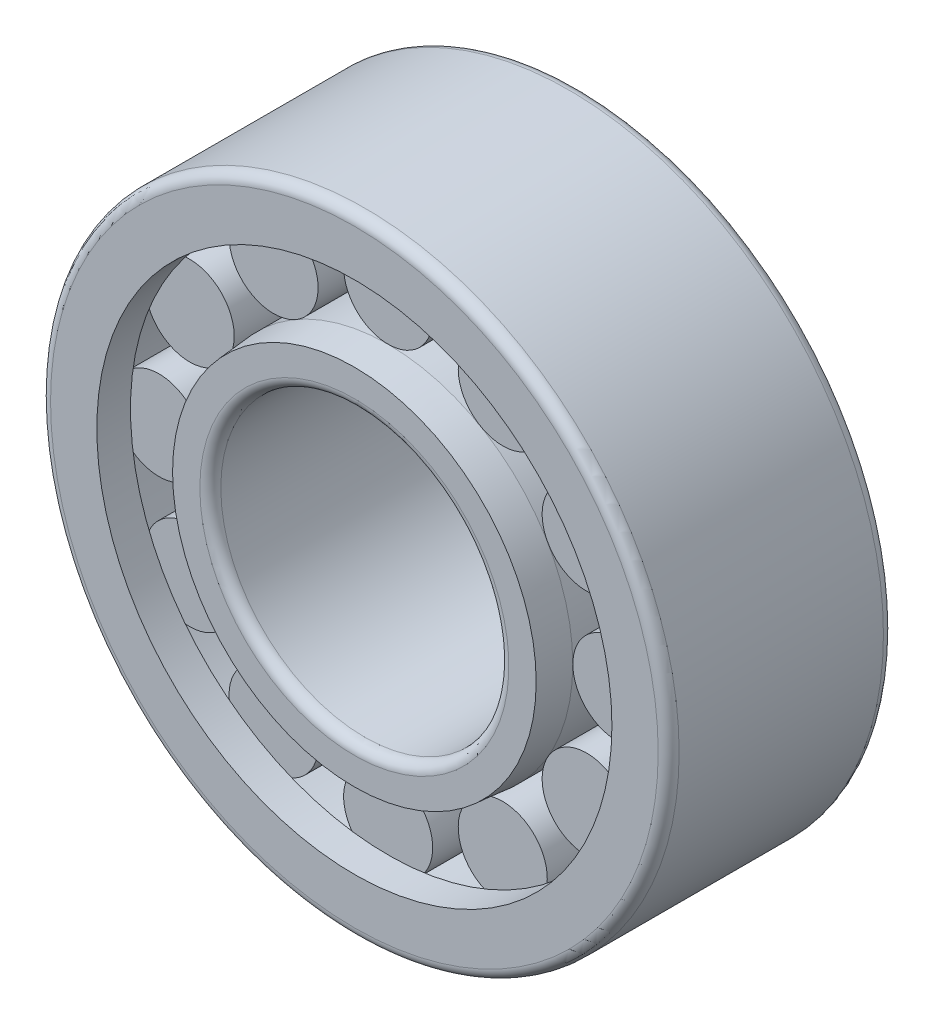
ISO-10303-21;
HEADER;
FILE_DESCRIPTION(('STEP AP214'),'2;1');
FILE_NAME('part.step','',(''),(''),'','','');
FILE_SCHEMA(('AUTOMOTIVE_DESIGN { 1 0 10303 214 1 1 1 1 }'));
ENDSEC;
DATA;
#1=APPLICATION_CONTEXT('core data for automotive mechanical design processes');
#2=APPLICATION_PROTOCOL_DEFINITION('international standard','automotive_design',2000,#1);
#3=PRODUCT_CONTEXT('',#1,'mechanical');
#4=PRODUCT('Part','Part','',(#3));
#5=PRODUCT_RELATED_PRODUCT_CATEGORY('part','',(#4));
#6=PRODUCT_DEFINITION_FORMATION('','',#4);
#7=PRODUCT_DEFINITION_CONTEXT('part definition',#1,'design');
#8=PRODUCT_DEFINITION('design','',#6,#7);
#9=PRODUCT_DEFINITION_SHAPE('','',#8);
#10=(LENGTH_UNIT() NAMED_UNIT(*) SI_UNIT(.MILLI.,.METRE.));
#11=(NAMED_UNIT(*) PLANE_ANGLE_UNIT() SI_UNIT($,.RADIAN.));
#12=(NAMED_UNIT(*) SI_UNIT($,.STERADIAN.) SOLID_ANGLE_UNIT());
#13=UNCERTAINTY_MEASURE_WITH_UNIT(LENGTH_MEASURE(1.E-05),#10,'distance_accuracy_value','');
#14=(GEOMETRIC_REPRESENTATION_CONTEXT(3) GLOBAL_UNCERTAINTY_ASSIGNED_CONTEXT((#13)) GLOBAL_UNIT_ASSIGNED_CONTEXT((#10,
#11,#12)) REPRESENTATION_CONTEXT('',''));
#15=CARTESIAN_POINT('',(0.,0.,0.));
#16=DIRECTION('',(0.,0.,1.));
#17=DIRECTION('',(1.,0.,0.));
#18=AXIS2_PLACEMENT_3D('',#15,#16,#17);
#19=CARTESIAN_POINT('',(0.,27.5,21.5));
#20=DIRECTION('',(0.,0.,-1.));
#21=DIRECTION('',(-1.,0.,0.));
#22=AXIS2_PLACEMENT_3D('',#19,#20,#21);
#23=PLANE('',#22);
#24=CARTESIAN_POINT('',(0.,0.,21.5));
#25=DIRECTION('',(0.,0.,-1.));
#26=DIRECTION('',(-1.,0.,0.));
#27=AXIS2_PLACEMENT_3D('',#24,#25,#26);
#28=CIRCLE('',#27,29.5);
#29=CARTESIAN_POINT('',(-29.5,0.,21.5));
#30=VERTEX_POINT('',#29);
#31=EDGE_CURVE('E490',#30,#30,#28,.T.);
#32=ORIENTED_EDGE('',*,*,#31,.T.);
#33=EDGE_LOOP('',(#32));
#34=FACE_BOUND('',#33,.T.);
#35=CARTESIAN_POINT('',(0.,0.,21.5));
#36=DIRECTION('',(0.,0.,1.));
#37=DIRECTION('',(1.,0.,0.));
#38=AXIS2_PLACEMENT_3D('',#35,#36,#37);
#39=CIRCLE('',#38,34.707885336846);
#40=CARTESIAN_POINT('',(34.707885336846,0.,21.5));
#41=VERTEX_POINT('',#40);
#42=EDGE_CURVE('E561',#41,#41,#39,.T.);
#43=ORIENTED_EDGE('',*,*,#42,.T.);
#44=EDGE_LOOP('',(#43));
#45=FACE_BOUND('',#44,.T.);
#46=ADVANCED_FACE('F35',(#34,#45),#23,.F.);
#47=CARTESIAN_POINT('',(0.,27.5,-21.5));
#48=DIRECTION('',(0.,0.,1.));
#49=DIRECTION('',(1.,0.,0.));
#50=AXIS2_PLACEMENT_3D('',#47,#48,#49);
#51=PLANE('',#50);
#52=CARTESIAN_POINT('',(0.,0.,-21.5));
#53=DIRECTION('',(0.,0.,1.));
#54=DIRECTION('',(1.,0.,0.));
#55=AXIS2_PLACEMENT_3D('',#52,#53,#54);
#56=CIRCLE('',#55,29.5);
#57=CARTESIAN_POINT('',(29.5,0.,-21.5));
#58=VERTEX_POINT('',#57);
#59=EDGE_CURVE('E499',#58,#58,#56,.T.);
#60=ORIENTED_EDGE('',*,*,#59,.T.);
#61=EDGE_LOOP('',(#60));
#62=FACE_BOUND('',#61,.T.);
#63=CARTESIAN_POINT('',(0.,0.,-21.5));
#64=DIRECTION('',(0.,0.,1.));
#65=DIRECTION('',(1.,0.,0.));
#66=AXIS2_PLACEMENT_3D('',#63,#64,#65);
#67=CIRCLE('',#66,34.707885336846);
#68=CARTESIAN_POINT('',(34.707885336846,0.,-21.5));
#69=VERTEX_POINT('',#68);
#70=EDGE_CURVE('E555',#69,#69,#67,.T.);
#71=ORIENTED_EDGE('',*,*,#70,.F.);
#72=EDGE_LOOP('',(#71));
#73=FACE_BOUND('',#72,.T.);
#74=ADVANCED_FACE('F826',(#62,#73),#51,.F.);
#75=CARTESIAN_POINT('',(0.,35.25,15.05));
#76=DIRECTION('',(0.,0.,1.));
#77=DIRECTION('',(0.,-1.,0.));
#78=AXIS2_PLACEMENT_3D('',#75,#76,#77);
#79=PLANE('',#78);
#80=CARTESIAN_POINT('',(0.,43.75,15.05));
#81=DIRECTION('',(0.,0.,1.));
#82=DIRECTION('',(0.,-1.,0.));
#83=AXIS2_PLACEMENT_3D('',#80,#81,#82);
#84=CIRCLE('',#83,8.49999999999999);
#85=CARTESIAN_POINT('',(-0.636717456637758,52.2261188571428,15.05));
#86=VERTEX_POINT('',#85);
#87=CARTESIAN_POINT('',(-0.523221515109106,35.2661188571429,15.05));
#88=VERTEX_POINT('',#87);
#89=EDGE_CURVE('E518',#86,#88,#84,.T.);
#90=ORIENTED_EDGE('',*,*,#89,.T.);
#91=CARTESIAN_POINT('',(0.,0.,15.05));
#92=DIRECTION('',(0.,0.,1.));
#93=DIRECTION('',(0.,-1.,0.));
#94=AXIS2_PLACEMENT_3D('',#91,#92,#93);
#95=CIRCLE('',#94,35.27);
#96=CARTESIAN_POINT('',(0.523221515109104,35.2661188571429,15.05));
#97=VERTEX_POINT('',#96);
#98=EDGE_CURVE('E546',#88,#97,#95,.F.);
#99=ORIENTED_EDGE('',*,*,#98,.T.);
#100=CARTESIAN_POINT('',(0.636717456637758,52.2261188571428,15.05));
#101=VERTEX_POINT('',#100);
#102=EDGE_CURVE('E521',#97,#101,#84,.T.);
#103=ORIENTED_EDGE('',*,*,#102,.T.);
#104=CARTESIAN_POINT('',(0.,0.,15.05));
#105=DIRECTION('',(0.,0.,1.));
#106=DIRECTION('',(0.,-1.,0.));
#107=AXIS2_PLACEMENT_3D('',#104,#105,#106);
#108=CIRCLE('',#107,52.23);
#109=EDGE_CURVE('E522',#101,#86,#108,.T.);
#110=ORIENTED_EDGE('',*,*,#109,.T.);
#111=EDGE_LOOP('',(#90,#99,#103,#110));
#112=FACE_BOUND('',#111,.T.);
#113=ADVANCED_FACE('F832',(#112),#79,.T.);
#114=CARTESIAN_POINT('',(0.,35.25,-15.05));
#115=DIRECTION('',(0.,0.,-1.));
#116=DIRECTION('',(0.,1.,0.));
#117=AXIS2_PLACEMENT_3D('',#114,#115,#116);
#118=PLANE('',#117);
#119=CARTESIAN_POINT('',(0.,43.75,-15.05));
#120=DIRECTION('',(0.,0.,1.));
#121=DIRECTION('',(0.,-1.,0.));
#122=AXIS2_PLACEMENT_3D('',#119,#120,#121);
#123=CIRCLE('',#122,8.49999999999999);
#124=CARTESIAN_POINT('',(0.523221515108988,35.2661188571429,-15.05));
#125=VERTEX_POINT('',#124);
#126=CARTESIAN_POINT('',(0.636717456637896,52.2261188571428,-15.05));
#127=VERTEX_POINT('',#126);
#128=EDGE_CURVE('E517',#125,#127,#123,.T.);
#129=ORIENTED_EDGE('',*,*,#128,.F.);
#130=CARTESIAN_POINT('',(0.,0.,-15.05));
#131=DIRECTION('',(0.,0.,-1.));
#132=DIRECTION('',(0.,1.,0.));
#133=AXIS2_PLACEMENT_3D('',#130,#131,#132);
#134=CIRCLE('',#133,35.27);
#135=CARTESIAN_POINT('',(-0.523221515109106,35.2661188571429,-15.05));
#136=VERTEX_POINT('',#135);
#137=EDGE_CURVE('E549',#125,#136,#134,.F.);
#138=ORIENTED_EDGE('',*,*,#137,.T.);
#139=CARTESIAN_POINT('',(-0.636717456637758,52.2261188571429,-15.05));
#140=VERTEX_POINT('',#139);
#141=EDGE_CURVE('E514',#140,#136,#123,.T.);
#142=ORIENTED_EDGE('',*,*,#141,.F.);
#143=CARTESIAN_POINT('',(0.,0.,-15.05));
#144=DIRECTION('',(0.,0.,-1.));
#145=DIRECTION('',(0.,1.,0.));
#146=AXIS2_PLACEMENT_3D('',#143,#144,#145);
#147=CIRCLE('',#146,52.23);
#148=EDGE_CURVE('E525',#140,#127,#147,.T.);
#149=ORIENTED_EDGE('',*,*,#148,.T.);
#150=EDGE_LOOP('',(#129,#138,#142,#149));
#151=FACE_BOUND('',#150,.T.);
#152=ADVANCED_FACE('F1474',(#151),#118,.T.);
#153=CARTESIAN_POINT('',(0.,43.75,15.05));
#154=DIRECTION('',(0.,0.,1.));
#155=DIRECTION('',(0.,-1.,0.));
#156=AXIS2_PLACEMENT_3D('',#153,#154,#155);
#157=CYLINDRICAL_SURFACE('',#156,8.49999999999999);
#158=ORIENTED_EDGE('',*,*,#102,.F.);
#159=DIRECTION('',(0.,0.,1.));
#160=VECTOR('',#159,1.);
#161=CARTESIAN_POINT('',(0.523221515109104,35.2661188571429,0.));
#162=LINE('',#161,#160);
#163=EDGE_CURVE('E502',#97,#125,#162,.F.);
#164=ORIENTED_EDGE('',*,*,#163,.T.);
#165=ORIENTED_EDGE('',*,*,#128,.T.);
#166=DIRECTION('',(0.,0.,1.));
#167=VECTOR('',#166,1.);
#168=CARTESIAN_POINT('',(0.636717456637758,52.2261188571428,0.));
#169=LINE('',#168,#167);
#170=EDGE_CURVE('E508',#127,#101,#169,.T.);
#171=ORIENTED_EDGE('',*,*,#170,.T.);
#172=EDGE_LOOP('',(#158,#164,#165,#171));
#173=FACE_BOUND('',#172,.T.);
#174=ADVANCED_FACE('F822',(#173),#157,.T.);
#175=ORIENTED_EDGE('',*,*,#141,.T.);
#176=DIRECTION('',(0.,0.,1.));
#177=VECTOR('',#176,1.);
#178=CARTESIAN_POINT('',(-0.523221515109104,35.2661188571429,0.));
#179=LINE('',#178,#177);
#180=EDGE_CURVE('E505',#136,#88,#179,.T.);
#181=ORIENTED_EDGE('',*,*,#180,.T.);
#182=ORIENTED_EDGE('',*,*,#89,.F.);
#183=DIRECTION('',(0.,0.,1.));
#184=VECTOR('',#183,1.);
#185=CARTESIAN_POINT('',(-0.636717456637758,52.2261188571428,0.));
#186=LINE('',#185,#184);
#187=EDGE_CURVE('E511',#86,#140,#186,.F.);
#188=ORIENTED_EDGE('',*,*,#187,.T.);
#189=EDGE_LOOP('',(#175,#181,#182,#188));
#190=FACE_BOUND('',#189,.T.);
#191=ADVANCED_FACE('F816',(#190),#157,.T.);
#192=CARTESIAN_POINT('',(0.,60.,21.5));
#193=DIRECTION('',(0.,0.,-1.));
#194=DIRECTION('',(-1.,0.,0.));
#195=AXIS2_PLACEMENT_3D('',#192,#193,#194);
#196=PLANE('',#195);
#197=CARTESIAN_POINT('',(0.,0.,21.5));
#198=DIRECTION('',(0.,0.,-1.));
#199=DIRECTION('',(-1.,0.,0.));
#200=AXIS2_PLACEMENT_3D('',#197,#198,#199);
#201=CIRCLE('',#200,58.);
#202=CARTESIAN_POINT('',(-58.,0.,21.5));
#203=VERTEX_POINT('',#202);
#204=EDGE_CURVE('E478',#203,#203,#201,.F.);
#205=ORIENTED_EDGE('',*,*,#204,.T.);
#206=EDGE_LOOP('',(#205));
#207=FACE_BOUND('',#206,.T.);
#208=CARTESIAN_POINT('',(0.,0.,21.5));
#209=DIRECTION('',(0.,0.,1.));
#210=DIRECTION('',(1.,0.,0.));
#211=AXIS2_PLACEMENT_3D('',#208,#209,#210);
#212=CIRCLE('',#211,49.1666666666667);
#213=CARTESIAN_POINT('',(49.1666666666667,0.,21.5));
#214=VERTEX_POINT('',#213);
#215=EDGE_CURVE('E528',#214,#214,#212,.T.);
#216=ORIENTED_EDGE('',*,*,#215,.F.);
#217=EDGE_LOOP('',(#216));
#218=FACE_BOUND('',#217,.T.);
#219=ADVANCED_FACE('F811',(#207,#218),#196,.F.);
#220=CARTESIAN_POINT('',(0.,0.,50.3916163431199));
#221=DIRECTION('',(0.,0.,1.));
#222=DIRECTION('',(1.,0.,0.));
#223=AXIS2_PLACEMENT_3D('',#220,#221,#222);
#224=CYLINDRICAL_SURFACE('',#223,49.1666666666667);
#225=CARTESIAN_POINT('',(0.,0.,15.075));
#226=DIRECTION('',(0.,0.,1.));
#227=DIRECTION('',(1.,0.,0.));
#228=AXIS2_PLACEMENT_3D('',#225,#226,#227);
#229=CIRCLE('',#228,49.1666666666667);
#230=CARTESIAN_POINT('',(49.1666666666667,0.,15.075));
#231=VERTEX_POINT('',#230);
#232=EDGE_CURVE('E531',#231,#231,#229,.T.);
#233=ORIENTED_EDGE('',*,*,#232,.F.);
#234=EDGE_LOOP('',(#233));
#235=FACE_BOUND('',#234,.T.);
#236=ORIENTED_EDGE('',*,*,#215,.T.);
#237=EDGE_LOOP('',(#236));
#238=FACE_BOUND('',#237,.T.);
#239=ADVANCED_FACE('F805',(#235,#238),#224,.F.);
#240=CARTESIAN_POINT('',(0.,49.1666666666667,15.075));
#241=DIRECTION('',(0.,0.,1.));
#242=DIRECTION('',(1.,0.,0.));
#243=AXIS2_PLACEMENT_3D('',#240,#241,#242);
#244=PLANE('',#243);
#245=CARTESIAN_POINT('',(0.,0.,15.075));
#246=DIRECTION('',(0.,0.,1.));
#247=DIRECTION('',(1.,0.,0.));
#248=AXIS2_PLACEMENT_3D('',#245,#246,#247);
#249=CIRCLE('',#248,52.23);
#250=CARTESIAN_POINT('',(52.23,0.,15.075));
#251=VERTEX_POINT('',#250);
#252=EDGE_CURVE('E534',#251,#251,#249,.T.);
#253=ORIENTED_EDGE('',*,*,#252,.F.);
#254=EDGE_LOOP('',(#253));
#255=FACE_BOUND('',#254,.T.);
#256=ORIENTED_EDGE('',*,*,#232,.T.);
#257=EDGE_LOOP('',(#256));
#258=FACE_BOUND('',#257,.T.);
#259=ADVANCED_FACE('F774',(#255,#258),#244,.F.);
#260=CARTESIAN_POINT('',(0.,0.,50.3916163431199));
#261=DIRECTION('',(0.,0.,1.));
#262=DIRECTION('',(1.,0.,0.));
#263=AXIS2_PLACEMENT_3D('',#260,#261,#262);
#264=CYLINDRICAL_SURFACE('',#263,52.23);
#265=CARTESIAN_POINT('',(0.,0.,-15.05));
#266=DIRECTION('',(0.,0.,-1.));
#267=DIRECTION('',(0.,1.,0.));
#268=AXIS2_PLACEMENT_3D('',#265,#266,#267);
#269=CIRCLE('',#268,52.23);
#270=CARTESIAN_POINT('',(-25.5616459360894,45.5475043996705,-15.05));
#271=VERTEX_POINT('',#270);
#272=CARTESIAN_POINT('',(-26.6644729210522,44.9107869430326,-15.05));
#273=VERTEX_POINT('',#272);
#274=EDGE_CURVE('E350',#271,#273,#269,.F.);
#275=ORIENTED_EDGE('',*,*,#274,.T.);
#276=DIRECTION('',(0.,0.,1.));
#277=VECTOR('',#276,1.);
#278=CARTESIAN_POINT('',(-26.6644729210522,44.9107869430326,0.));
#279=LINE('',#278,#277);
#280=CARTESIAN_POINT('',(-26.6644729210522,44.9107869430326,15.05));
#281=VERTEX_POINT('',#280);
#282=EDGE_CURVE('E758',#273,#281,#279,.T.);
#283=ORIENTED_EDGE('',*,*,#282,.T.);
#284=CARTESIAN_POINT('',(0.,0.,15.05));
#285=DIRECTION('',(0.,0.,1.));
#286=DIRECTION('',(0.,-1.,0.));
#287=AXIS2_PLACEMENT_3D('',#284,#285,#286);
#288=CIRCLE('',#287,52.23);
#289=CARTESIAN_POINT('',(-25.5616459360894,45.5475043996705,15.05));
#290=VERTEX_POINT('',#289);
#291=EDGE_CURVE('E754',#281,#290,#288,.F.);
#292=ORIENTED_EDGE('',*,*,#291,.T.);
#293=DIRECTION('',(0.,0.,1.));
#294=VECTOR('',#293,1.);
#295=CARTESIAN_POINT('',(-25.5616459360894,45.5475043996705,0.));
#296=LINE('',#295,#294);
#297=EDGE_CURVE('E352',#290,#271,#296,.F.);
#298=ORIENTED_EDGE('',*,*,#297,.T.);
#299=EDGE_LOOP('',(#275,#283,#292,#298));
#300=FACE_BOUND('',#299,.T.);
#301=CARTESIAN_POINT('',(0.,0.,-15.05));
#302=DIRECTION('',(0.,0.,-1.));
#303=DIRECTION('',(-1.,0.,0.));
#304=AXIS2_PLACEMENT_3D('',#301,#302,#303);
#305=CIRCLE('',#304,52.23);
#306=CARTESIAN_POINT('',(-44.910786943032,26.6644729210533,-15.05));
#307=VERTEX_POINT('',#306);
#308=CARTESIAN_POINT('',(-45.5475043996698,25.5616459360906,-15.05));
#309=VERTEX_POINT('',#308);
#310=EDGE_CURVE('E738',#307,#309,#305,.F.);
#311=ORIENTED_EDGE('',*,*,#310,.T.);
#312=DIRECTION('',(0.,0.,1.));
#313=VECTOR('',#312,1.);
#314=CARTESIAN_POINT('',(-45.5475043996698,25.5616459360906,0.));
#315=LINE('',#314,#313);
#316=CARTESIAN_POINT('',(-45.5475043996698,25.5616459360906,15.05));
#317=VERTEX_POINT('',#316);
#318=EDGE_CURVE('E741',#309,#317,#315,.T.);
#319=ORIENTED_EDGE('',*,*,#318,.T.);
#320=CARTESIAN_POINT('',(0.,0.,15.05));
#321=DIRECTION('',(0.,0.,1.));
#322=DIRECTION('',(1.,0.,0.));
#323=AXIS2_PLACEMENT_3D('',#320,#321,#322);
#324=CIRCLE('',#323,52.23);
#325=CARTESIAN_POINT('',(-44.910786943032,26.6644729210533,15.05));
#326=VERTEX_POINT('',#325);
#327=EDGE_CURVE('E735',#317,#326,#324,.F.);
#328=ORIENTED_EDGE('',*,*,#327,.T.);
#329=DIRECTION('',(0.,0.,1.));
#330=VECTOR('',#329,1.);
#331=CARTESIAN_POINT('',(-44.910786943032,26.6644729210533,0.));
#332=LINE('',#331,#330);
#333=EDGE_CURVE('E744',#326,#307,#332,.F.);
#334=ORIENTED_EDGE('',*,*,#333,.T.);
#335=EDGE_LOOP('',(#311,#319,#328,#334));
#336=FACE_BOUND('',#335,.T.);
#337=CARTESIAN_POINT('',(0.,0.,-15.05));
#338=DIRECTION('',(0.,0.,-1.));
#339=DIRECTION('',(-1.,0.,0.));
#340=AXIS2_PLACEMENT_3D('',#337,#338,#339);
#341=CIRCLE('',#340,52.23);
#342=CARTESIAN_POINT('',(-52.2261188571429,0.63671745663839,-15.05));
#343=VERTEX_POINT('',#342);
#344=CARTESIAN_POINT('',(-52.2261188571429,-0.636717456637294,-15.05));
#345=VERTEX_POINT('',#344);
#346=EDGE_CURVE('E719',#343,#345,#341,.F.);
#347=ORIENTED_EDGE('',*,*,#346,.T.);
#348=DIRECTION('',(0.,0.,1.));
#349=VECTOR('',#348,1.);
#350=CARTESIAN_POINT('',(-52.2261188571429,-0.636717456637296,0.));
#351=LINE('',#350,#349);
#352=CARTESIAN_POINT('',(-52.2261188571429,-0.636717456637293,15.05));
#353=VERTEX_POINT('',#352);
#354=EDGE_CURVE('E722',#345,#353,#351,.T.);
#355=ORIENTED_EDGE('',*,*,#354,.T.);
#356=CARTESIAN_POINT('',(0.,0.,15.05));
#357=DIRECTION('',(0.,0.,1.));
#358=DIRECTION('',(1.,0.,0.));
#359=AXIS2_PLACEMENT_3D('',#356,#357,#358);
#360=CIRCLE('',#359,52.23);
#361=CARTESIAN_POINT('',(-52.2261188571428,0.636717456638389,15.05));
#362=VERTEX_POINT('',#361);
#363=EDGE_CURVE('E716',#353,#362,#360,.F.);
#364=ORIENTED_EDGE('',*,*,#363,.T.);
#365=DIRECTION('',(0.,0.,1.));
#366=VECTOR('',#365,1.);
#367=CARTESIAN_POINT('',(-52.2261188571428,0.63671745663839,0.));
#368=LINE('',#367,#366);
#369=EDGE_CURVE('E725',#362,#343,#368,.F.);
#370=ORIENTED_EDGE('',*,*,#369,.T.);
#371=EDGE_LOOP('',(#347,#355,#364,#370));
#372=FACE_BOUND('',#371,.T.);
#373=CARTESIAN_POINT('',(0.,0.,-15.05));
#374=DIRECTION('',(0.,0.,-1.));
#375=DIRECTION('',(-1.,0.,0.));
#376=AXIS2_PLACEMENT_3D('',#373,#374,#375);
#377=CIRCLE('',#376,52.23);
#378=CARTESIAN_POINT('',(-45.5475043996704,-25.5616459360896,-15.05));
#379=VERTEX_POINT('',#378);
#380=CARTESIAN_POINT('',(-44.9107869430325,-26.6644729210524,-15.05));
#381=VERTEX_POINT('',#380);
#382=EDGE_CURVE('E700',#379,#381,#377,.F.);
#383=ORIENTED_EDGE('',*,*,#382,.T.);
#384=DIRECTION('',(0.,0.,1.));
#385=VECTOR('',#384,1.);
#386=CARTESIAN_POINT('',(-44.9107869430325,-26.6644729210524,0.));
#387=LINE('',#386,#385);
#388=CARTESIAN_POINT('',(-44.9107869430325,-26.6644729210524,15.05));
#389=VERTEX_POINT('',#388);
#390=EDGE_CURVE('E703',#381,#389,#387,.T.);
#391=ORIENTED_EDGE('',*,*,#390,.T.);
#392=CARTESIAN_POINT('',(0.,0.,15.05));
#393=DIRECTION('',(0.,0.,1.));
#394=DIRECTION('',(1.,0.,0.));
#395=AXIS2_PLACEMENT_3D('',#392,#393,#394);
#396=CIRCLE('',#395,52.23);
#397=CARTESIAN_POINT('',(-45.5475043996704,-25.5616459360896,15.05));
#398=VERTEX_POINT('',#397);
#399=EDGE_CURVE('E697',#389,#398,#396,.F.);
#400=ORIENTED_EDGE('',*,*,#399,.T.);
#401=DIRECTION('',(0.,0.,1.));
#402=VECTOR('',#401,1.);
#403=CARTESIAN_POINT('',(-45.5475043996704,-25.5616459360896,0.));
#404=LINE('',#403,#402);
#405=EDGE_CURVE('E706',#398,#379,#404,.F.);
#406=ORIENTED_EDGE('',*,*,#405,.T.);
#407=EDGE_LOOP('',(#383,#391,#400,#406));
#408=FACE_BOUND('',#407,.T.);
#409=CARTESIAN_POINT('',(0.,0.,-15.05));
#410=DIRECTION('',(0.,0.,-1.));
#411=DIRECTION('',(0.,1.,0.));
#412=AXIS2_PLACEMENT_3D('',#409,#410,#411);
#413=CIRCLE('',#412,52.23);
#414=CARTESIAN_POINT('',(-26.6644729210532,-44.9107869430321,-15.05));
#415=VERTEX_POINT('',#414);
#416=CARTESIAN_POINT('',(-25.5616459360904,-45.5475043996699,-15.05));
#417=VERTEX_POINT('',#416);
#418=EDGE_CURVE('E681',#415,#417,#413,.F.);
#419=ORIENTED_EDGE('',*,*,#418,.T.);
#420=DIRECTION('',(0.,0.,1.));
#421=VECTOR('',#420,1.);
#422=CARTESIAN_POINT('',(-25.5616459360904,-45.5475043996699,0.));
#423=LINE('',#422,#421);
#424=CARTESIAN_POINT('',(-25.5616459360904,-45.5475043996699,15.05));
#425=VERTEX_POINT('',#424);
#426=EDGE_CURVE('E684',#417,#425,#423,.T.);
#427=ORIENTED_EDGE('',*,*,#426,.T.);
#428=CARTESIAN_POINT('',(0.,0.,15.05));
#429=DIRECTION('',(0.,0.,1.));
#430=DIRECTION('',(0.,-1.,0.));
#431=AXIS2_PLACEMENT_3D('',#428,#429,#430);
#432=CIRCLE('',#431,52.23);
#433=CARTESIAN_POINT('',(-26.6644729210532,-44.9107869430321,15.05));
#434=VERTEX_POINT('',#433);
#435=EDGE_CURVE('E678',#425,#434,#432,.F.);
#436=ORIENTED_EDGE('',*,*,#435,.T.);
#437=DIRECTION('',(0.,0.,1.));
#438=VECTOR('',#437,1.);
#439=CARTESIAN_POINT('',(-26.6644729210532,-44.9107869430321,0.));
#440=LINE('',#439,#438);
#441=EDGE_CURVE('E687',#434,#415,#440,.F.);
#442=ORIENTED_EDGE('',*,*,#441,.T.);
#443=EDGE_LOOP('',(#419,#427,#436,#442));
#444=FACE_BOUND('',#443,.T.);
#445=CARTESIAN_POINT('',(0.,0.,-15.05));
#446=DIRECTION('',(0.,0.,-1.));
#447=DIRECTION('',(0.,1.,0.));
#448=AXIS2_PLACEMENT_3D('',#445,#446,#447);
#449=CIRCLE('',#448,52.23);
#450=CARTESIAN_POINT('',(-0.636717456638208,-52.2261188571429,-15.05));
#451=VERTEX_POINT('',#450);
#452=CARTESIAN_POINT('',(0.636717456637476,-52.2261188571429,-15.05));
#453=VERTEX_POINT('',#452);
#454=EDGE_CURVE('E662',#451,#453,#449,.F.);
#455=ORIENTED_EDGE('',*,*,#454,.T.);
#456=DIRECTION('',(0.,0.,1.));
#457=VECTOR('',#456,1.);
#458=CARTESIAN_POINT('',(0.636717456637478,-52.2261188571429,0.));
#459=LINE('',#458,#457);
#460=CARTESIAN_POINT('',(0.636717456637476,-52.2261188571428,15.05));
#461=VERTEX_POINT('',#460);
#462=EDGE_CURVE('E665',#453,#461,#459,.T.);
#463=ORIENTED_EDGE('',*,*,#462,.T.);
#464=CARTESIAN_POINT('',(0.,0.,15.05));
#465=DIRECTION('',(0.,0.,1.));
#466=DIRECTION('',(0.,-1.,0.));
#467=AXIS2_PLACEMENT_3D('',#464,#465,#466);
#468=CIRCLE('',#467,52.23);
#469=CARTESIAN_POINT('',(-0.636717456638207,-52.2261188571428,15.05));
#470=VERTEX_POINT('',#469);
#471=EDGE_CURVE('E659',#461,#470,#468,.F.);
#472=ORIENTED_EDGE('',*,*,#471,.T.);
#473=DIRECTION('',(0.,0.,1.));
#474=VECTOR('',#473,1.);
#475=CARTESIAN_POINT('',(-0.636717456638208,-52.2261188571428,0.));
#476=LINE('',#475,#474);
#477=EDGE_CURVE('E668',#470,#451,#476,.F.);
#478=ORIENTED_EDGE('',*,*,#477,.T.);
#479=EDGE_LOOP('',(#455,#463,#472,#478));
#480=FACE_BOUND('',#479,.T.);
#481=CARTESIAN_POINT('',(0.,0.,-15.05));
#482=DIRECTION('',(0.,0.,-1.));
#483=DIRECTION('',(0.,1.,0.));
#484=AXIS2_PLACEMENT_3D('',#481,#482,#483);
#485=CIRCLE('',#484,52.23);
#486=CARTESIAN_POINT('',(25.5616459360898,-45.5475043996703,-15.05));
#487=VERTEX_POINT('',#486);
#488=CARTESIAN_POINT('',(26.6644729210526,-44.9107869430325,-15.05));
#489=VERTEX_POINT('',#488);
#490=EDGE_CURVE('E643',#487,#489,#485,.F.);
#491=ORIENTED_EDGE('',*,*,#490,.T.);
#492=DIRECTION('',(0.,0.,1.));
#493=VECTOR('',#492,1.);
#494=CARTESIAN_POINT('',(26.6644729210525,-44.9107869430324,0.));
#495=LINE('',#494,#493);
#496=CARTESIAN_POINT('',(26.6644729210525,-44.9107869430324,15.05));
#497=VERTEX_POINT('',#496);
#498=EDGE_CURVE('E646',#489,#497,#495,.T.);
#499=ORIENTED_EDGE('',*,*,#498,.T.);
#500=CARTESIAN_POINT('',(0.,0.,15.05));
#501=DIRECTION('',(0.,0.,1.));
#502=DIRECTION('',(0.,-1.,0.));
#503=AXIS2_PLACEMENT_3D('',#500,#501,#502);
#504=CIRCLE('',#503,52.23);
#505=CARTESIAN_POINT('',(25.5616459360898,-45.5475043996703,15.05));
#506=VERTEX_POINT('',#505);
#507=EDGE_CURVE('E640',#497,#506,#504,.F.);
#508=ORIENTED_EDGE('',*,*,#507,.T.);
#509=DIRECTION('',(0.,0.,1.));
#510=VECTOR('',#509,1.);
#511=CARTESIAN_POINT('',(25.5616459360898,-45.5475043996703,0.));
#512=LINE('',#511,#510);
#513=EDGE_CURVE('E649',#506,#487,#512,.F.);
#514=ORIENTED_EDGE('',*,*,#513,.T.);
#515=EDGE_LOOP('',(#491,#499,#508,#514));
#516=FACE_BOUND('',#515,.T.);
#517=CARTESIAN_POINT('',(0.,0.,-15.05));
#518=DIRECTION('',(0.,0.,-1.));
#519=DIRECTION('',(-1.,0.,0.));
#520=AXIS2_PLACEMENT_3D('',#517,#518,#519);
#521=CIRCLE('',#520,52.23);
#522=CARTESIAN_POINT('',(44.9107869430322,-26.664472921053,-15.05));
#523=VERTEX_POINT('',#522);
#524=CARTESIAN_POINT('',(45.54750439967,-25.5616459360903,-15.05));
#525=VERTEX_POINT('',#524);
#526=EDGE_CURVE('E624',#523,#525,#521,.F.);
#527=ORIENTED_EDGE('',*,*,#526,.T.);
#528=DIRECTION('',(0.,0.,1.));
#529=VECTOR('',#528,1.);
#530=CARTESIAN_POINT('',(45.54750439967,-25.5616459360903,0.));
#531=LINE('',#530,#529);
#532=CARTESIAN_POINT('',(45.54750439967,-25.5616459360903,15.05));
#533=VERTEX_POINT('',#532);
#534=EDGE_CURVE('E627',#525,#533,#531,.T.);
#535=ORIENTED_EDGE('',*,*,#534,.T.);
#536=CARTESIAN_POINT('',(0.,0.,15.05));
#537=DIRECTION('',(0.,0.,1.));
#538=DIRECTION('',(1.,0.,0.));
#539=AXIS2_PLACEMENT_3D('',#536,#537,#538);
#540=CIRCLE('',#539,52.23);
#541=CARTESIAN_POINT('',(44.9107869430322,-26.664472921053,15.05));
#542=VERTEX_POINT('',#541);
#543=EDGE_CURVE('E621',#533,#542,#540,.F.);
#544=ORIENTED_EDGE('',*,*,#543,.T.);
#545=DIRECTION('',(0.,0.,1.));
#546=VECTOR('',#545,1.);
#547=CARTESIAN_POINT('',(44.9107869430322,-26.664472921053,0.));
#548=LINE('',#547,#546);
#549=EDGE_CURVE('E630',#542,#523,#548,.F.);
#550=ORIENTED_EDGE('',*,*,#549,.T.);
#551=EDGE_LOOP('',(#527,#535,#544,#550));
#552=FACE_BOUND('',#551,.T.);
#553=CARTESIAN_POINT('',(0.,0.,-15.05));
#554=DIRECTION('',(0.,0.,-1.));
#555=DIRECTION('',(-1.,0.,0.));
#556=AXIS2_PLACEMENT_3D('',#553,#554,#555);
#557=CIRCLE('',#556,52.23);
#558=CARTESIAN_POINT('',(52.2261188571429,-0.636717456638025,-15.05));
#559=VERTEX_POINT('',#558);
#560=CARTESIAN_POINT('',(52.2261188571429,0.636717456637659,-15.05));
#561=VERTEX_POINT('',#560);
#562=EDGE_CURVE('E605',#559,#561,#557,.F.);
#563=ORIENTED_EDGE('',*,*,#562,.T.);
#564=DIRECTION('',(0.,0.,1.));
#565=VECTOR('',#564,1.);
#566=CARTESIAN_POINT('',(52.2261188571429,0.636717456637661,0.));
#567=LINE('',#566,#565);
#568=CARTESIAN_POINT('',(52.2261188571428,0.636717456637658,15.05));
#569=VERTEX_POINT('',#568);
#570=EDGE_CURVE('E608',#561,#569,#567,.T.);
#571=ORIENTED_EDGE('',*,*,#570,.T.);
#572=CARTESIAN_POINT('',(0.,0.,15.05));
#573=DIRECTION('',(0.,0.,1.));
#574=DIRECTION('',(1.,0.,0.));
#575=AXIS2_PLACEMENT_3D('',#572,#573,#574);
#576=CIRCLE('',#575,52.23);
#577=CARTESIAN_POINT('',(52.2261188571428,-0.636717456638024,15.05));
#578=VERTEX_POINT('',#577);
#579=EDGE_CURVE('E602',#569,#578,#576,.F.);
#580=ORIENTED_EDGE('',*,*,#579,.T.);
#581=DIRECTION('',(0.,0.,1.));
#582=VECTOR('',#581,1.);
#583=CARTESIAN_POINT('',(52.2261188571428,-0.636717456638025,0.));
#584=LINE('',#583,#582);
#585=EDGE_CURVE('E611',#578,#559,#584,.F.);
#586=ORIENTED_EDGE('',*,*,#585,.T.);
#587=EDGE_LOOP('',(#563,#571,#580,#586));
#588=FACE_BOUND('',#587,.T.);
#589=CARTESIAN_POINT('',(0.,0.,-15.05));
#590=DIRECTION('',(0.,0.,-1.));
#591=DIRECTION('',(-1.,0.,0.));
#592=AXIS2_PLACEMENT_3D('',#589,#590,#591);
#593=CIRCLE('',#592,52.23);
#594=CARTESIAN_POINT('',(45.5475043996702,25.5616459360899,-15.05));
#595=VERTEX_POINT('',#594);
#596=CARTESIAN_POINT('',(44.9107869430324,26.6644729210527,-15.05));
#597=VERTEX_POINT('',#596);
#598=EDGE_CURVE('E586',#595,#597,#593,.F.);
#599=ORIENTED_EDGE('',*,*,#598,.T.);
#600=DIRECTION('',(0.,0.,1.));
#601=VECTOR('',#600,1.);
#602=CARTESIAN_POINT('',(44.9107869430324,26.6644729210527,0.));
#603=LINE('',#602,#601);
#604=CARTESIAN_POINT('',(44.9107869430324,26.6644729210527,15.05));
#605=VERTEX_POINT('',#604);
#606=EDGE_CURVE('E589',#597,#605,#603,.T.);
#607=ORIENTED_EDGE('',*,*,#606,.T.);
#608=CARTESIAN_POINT('',(0.,0.,15.05));
#609=DIRECTION('',(0.,0.,1.));
#610=DIRECTION('',(1.,0.,0.));
#611=AXIS2_PLACEMENT_3D('',#608,#609,#610);
#612=CIRCLE('',#611,52.23);
#613=CARTESIAN_POINT('',(45.5475043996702,25.5616459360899,15.05));
#614=VERTEX_POINT('',#613);
#615=EDGE_CURVE('E583',#605,#614,#612,.F.);
#616=ORIENTED_EDGE('',*,*,#615,.T.);
#617=DIRECTION('',(0.,0.,1.));
#618=VECTOR('',#617,1.);
#619=CARTESIAN_POINT('',(45.5475043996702,25.5616459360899,0.));
#620=LINE('',#619,#618);
#621=EDGE_CURVE('E592',#614,#595,#620,.F.);
#622=ORIENTED_EDGE('',*,*,#621,.T.);
#623=EDGE_LOOP('',(#599,#607,#616,#622));
#624=FACE_BOUND('',#623,.T.);
#625=CARTESIAN_POINT('',(0.,0.,-15.05));
#626=DIRECTION('',(0.,0.,-1.));
#627=DIRECTION('',(0.,1.,0.));
#628=AXIS2_PLACEMENT_3D('',#625,#626,#627);
#629=CIRCLE('',#628,52.23);
#630=CARTESIAN_POINT('',(26.6644729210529,44.9107869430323,-15.05));
#631=VERTEX_POINT('',#630);
#632=CARTESIAN_POINT('',(25.5616459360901,45.5475043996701,-15.05));
#633=VERTEX_POINT('',#632);
#634=EDGE_CURVE('E567',#631,#633,#629,.F.);
#635=ORIENTED_EDGE('',*,*,#634,.T.);
#636=DIRECTION('',(0.,0.,1.));
#637=VECTOR('',#636,1.);
#638=CARTESIAN_POINT('',(25.5616459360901,45.5475043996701,0.));
#639=LINE('',#638,#637);
#640=CARTESIAN_POINT('',(25.5616459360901,45.5475043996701,15.05));
#641=VERTEX_POINT('',#640);
#642=EDGE_CURVE('E570',#633,#641,#639,.T.);
#643=ORIENTED_EDGE('',*,*,#642,.T.);
#644=CARTESIAN_POINT('',(0.,0.,15.05));
#645=DIRECTION('',(0.,0.,1.));
#646=DIRECTION('',(0.,-1.,0.));
#647=AXIS2_PLACEMENT_3D('',#644,#645,#646);
#648=CIRCLE('',#647,52.23);
#649=CARTESIAN_POINT('',(26.6644729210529,44.9107869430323,15.05));
#650=VERTEX_POINT('',#649);
#651=EDGE_CURVE('E564',#641,#650,#648,.F.);
#652=ORIENTED_EDGE('',*,*,#651,.T.);
#653=DIRECTION('',(0.,0.,1.));
#654=VECTOR('',#653,1.);
#655=CARTESIAN_POINT('',(26.6644729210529,44.9107869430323,0.));
#656=LINE('',#655,#654);
#657=EDGE_CURVE('E573',#650,#631,#656,.F.);
#658=ORIENTED_EDGE('',*,*,#657,.T.);
#659=EDGE_LOOP('',(#635,#643,#652,#658));
#660=FACE_BOUND('',#659,.T.);
#661=ORIENTED_EDGE('',*,*,#170,.F.);
#662=ORIENTED_EDGE('',*,*,#148,.F.);
#663=ORIENTED_EDGE('',*,*,#187,.F.);
#664=ORIENTED_EDGE('',*,*,#109,.F.);
#665=EDGE_LOOP('',(#661,#662,#663,#664));
#666=FACE_BOUND('',#665,.T.);
#667=CARTESIAN_POINT('',(0.,0.,-15.075));
#668=DIRECTION('',(0.,0.,1.));
#669=DIRECTION('',(1.,0.,0.));
#670=AXIS2_PLACEMENT_3D('',#667,#668,#669);
#671=CIRCLE('',#670,52.23);
#672=CARTESIAN_POINT('',(52.23,0.,-15.075));
#673=VERTEX_POINT('',#672);
#674=EDGE_CURVE('E537',#673,#673,#671,.T.);
#675=ORIENTED_EDGE('',*,*,#674,.F.);
#676=EDGE_LOOP('',(#675));
#677=FACE_BOUND('',#676,.T.);
#678=ORIENTED_EDGE('',*,*,#252,.T.);
#679=EDGE_LOOP('',(#678));
#680=FACE_BOUND('',#679,.T.);
#681=ADVANCED_FACE('F770',(#300,#336,#372,#408,#444,#480,#516,#552,#588,#624,#660,#666,#677,
#680),#264,.F.);
#682=CARTESIAN_POINT('',(0.,49.1666666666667,-15.075));
#683=DIRECTION('',(0.,0.,-1.));
#684=DIRECTION('',(-1.,0.,0.));
#685=AXIS2_PLACEMENT_3D('',#682,#683,#684);
#686=PLANE('',#685);
#687=CARTESIAN_POINT('',(0.,0.,-15.075));
#688=DIRECTION('',(0.,0.,1.));
#689=DIRECTION('',(1.,0.,0.));
#690=AXIS2_PLACEMENT_3D('',#687,#688,#689);
#691=CIRCLE('',#690,49.1666666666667);
#692=CARTESIAN_POINT('',(49.1666666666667,0.,-15.075));
#693=VERTEX_POINT('',#692);
#694=EDGE_CURVE('E540',#693,#693,#691,.T.);
#695=ORIENTED_EDGE('',*,*,#694,.F.);
#696=EDGE_LOOP('',(#695));
#697=FACE_BOUND('',#696,.T.);
#698=ORIENTED_EDGE('',*,*,#674,.T.);
#699=EDGE_LOOP('',(#698));
#700=FACE_BOUND('',#699,.T.);
#701=ADVANCED_FACE('F773',(#697,#700),#686,.F.);
#702=CARTESIAN_POINT('',(0.,0.,50.3916163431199));
#703=DIRECTION('',(0.,0.,1.));
#704=DIRECTION('',(1.,0.,0.));
#705=AXIS2_PLACEMENT_3D('',#702,#703,#704);
#706=CYLINDRICAL_SURFACE('',#705,49.1666666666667);
#707=CARTESIAN_POINT('',(0.,0.,-21.5));
#708=DIRECTION('',(0.,0.,1.));
#709=DIRECTION('',(1.,0.,0.));
#710=AXIS2_PLACEMENT_3D('',#707,#708,#709);
#711=CIRCLE('',#710,49.1666666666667);
#712=CARTESIAN_POINT('',(49.1666666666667,0.,-21.5));
#713=VERTEX_POINT('',#712);
#714=EDGE_CURVE('E543',#713,#713,#711,.T.);
#715=ORIENTED_EDGE('',*,*,#714,.F.);
#716=EDGE_LOOP('',(#715));
#717=FACE_BOUND('',#716,.T.);
#718=ORIENTED_EDGE('',*,*,#694,.T.);
#719=EDGE_LOOP('',(#718));
#720=FACE_BOUND('',#719,.T.);
#721=ADVANCED_FACE('F845',(#717,#720),#706,.F.);
#722=CARTESIAN_POINT('',(0.,60.,-21.5));
#723=DIRECTION('',(0.,0.,1.));
#724=DIRECTION('',(1.,0.,0.));
#725=AXIS2_PLACEMENT_3D('',#722,#723,#724);
#726=PLANE('',#725);
#727=CARTESIAN_POINT('',(0.,0.,-21.5));
#728=DIRECTION('',(0.,0.,1.));
#729=DIRECTION('',(1.,0.,0.));
#730=AXIS2_PLACEMENT_3D('',#727,#728,#729);
#731=CIRCLE('',#730,58.);
#732=CARTESIAN_POINT('',(58.,0.,-21.5));
#733=VERTEX_POINT('',#732);
#734=EDGE_CURVE('E481',#733,#733,#731,.F.);
#735=ORIENTED_EDGE('',*,*,#734,.T.);
#736=EDGE_LOOP('',(#735));
#737=FACE_BOUND('',#736,.T.);
#738=ORIENTED_EDGE('',*,*,#714,.T.);
#739=EDGE_LOOP('',(#738));
#740=FACE_BOUND('',#739,.T.);
#741=ADVANCED_FACE('F841',(#737,#740),#726,.F.);
#742=CARTESIAN_POINT('',(0.,0.,50.3916163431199));
#743=DIRECTION('',(0.,0.,1.));
#744=DIRECTION('',(1.,0.,0.));
#745=AXIS2_PLACEMENT_3D('',#742,#743,#744);
#746=CYLINDRICAL_SURFACE('',#745,60.);
#747=CARTESIAN_POINT('',(0.,0.,-19.5));
#748=DIRECTION('',(0.,0.,1.));
#749=DIRECTION('',(1.,0.,0.));
#750=AXIS2_PLACEMENT_3D('',#747,#748,#749);
#751=CIRCLE('',#750,60.);
#752=CARTESIAN_POINT('',(60.,0.,-19.5));
#753=VERTEX_POINT('',#752);
#754=EDGE_CURVE('E484',#753,#753,#751,.T.);
#755=ORIENTED_EDGE('',*,*,#754,.T.);
#756=EDGE_LOOP('',(#755));
#757=FACE_BOUND('',#756,.T.);
#758=CARTESIAN_POINT('',(0.,0.,19.5));
#759=DIRECTION('',(0.,0.,-1.));
#760=DIRECTION('',(-1.,0.,0.));
#761=AXIS2_PLACEMENT_3D('',#758,#759,#760);
#762=CIRCLE('',#761,60.);
#763=CARTESIAN_POINT('',(-60.,0.,19.5));
#764=VERTEX_POINT('',#763);
#765=EDGE_CURVE('E487',#764,#764,#762,.T.);
#766=ORIENTED_EDGE('',*,*,#765,.T.);
#767=EDGE_LOOP('',(#766));
#768=FACE_BOUND('',#767,.T.);
#769=ADVANCED_FACE('F838',(#757,#768),#746,.T.);
#770=CARTESIAN_POINT('',(0.,0.,70.8625909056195));
#771=DIRECTION('',(0.,0.,1.));
#772=DIRECTION('',(1.,0.,0.));
#773=AXIS2_PLACEMENT_3D('',#770,#771,#772);
#774=CYLINDRICAL_SURFACE('',#773,35.27);
#775=CARTESIAN_POINT('',(0.,0.,15.05));
#776=DIRECTION('',(0.,0.,1.));
#777=DIRECTION('',(0.,-1.,0.));
#778=AXIS2_PLACEMENT_3D('',#775,#776,#777);
#779=CIRCLE('',#778,35.27);
#780=CARTESIAN_POINT('',(-17.1799363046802,30.8029655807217,15.05));
#781=VERTEX_POINT('',#780);
#782=CARTESIAN_POINT('',(-18.0861825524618,30.279744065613,15.05));
#783=VERTEX_POINT('',#782);
#784=EDGE_CURVE('E43',#781,#783,#779,.T.);
#785=ORIENTED_EDGE('',*,*,#784,.T.);
#786=DIRECTION('',(0.,0.,1.));
#787=VECTOR('',#786,1.);
#788=CARTESIAN_POINT('',(-18.0861825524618,30.279744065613,0.));
#789=LINE('',#788,#787);
#790=CARTESIAN_POINT('',(-18.0861825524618,30.279744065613,-15.05));
#791=VERTEX_POINT('',#790);
#792=EDGE_CURVE('E11',#783,#791,#789,.F.);
#793=ORIENTED_EDGE('',*,*,#792,.T.);
#794=CARTESIAN_POINT('',(0.,0.,-15.05));
#795=DIRECTION('',(0.,0.,-1.));
#796=DIRECTION('',(0.,1.,0.));
#797=AXIS2_PLACEMENT_3D('',#794,#795,#796);
#798=CIRCLE('',#797,35.27);
#799=CARTESIAN_POINT('',(-17.1799363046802,30.8029655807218,-15.05));
#800=VERTEX_POINT('',#799);
#801=EDGE_CURVE('E342',#791,#800,#798,.T.);
#802=ORIENTED_EDGE('',*,*,#801,.T.);
#803=DIRECTION('',(0.,0.,1.));
#804=VECTOR('',#803,1.);
#805=CARTESIAN_POINT('',(-17.1799363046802,30.8029655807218,0.));
#806=LINE('',#805,#804);
#807=EDGE_CURVE('E337',#800,#781,#806,.T.);
#808=ORIENTED_EDGE('',*,*,#807,.T.);
#809=EDGE_LOOP('',(#785,#793,#802,#808));
#810=FACE_BOUND('',#809,.T.);
#811=CARTESIAN_POINT('',(0.,0.,15.05));
#812=DIRECTION('',(0.,0.,1.));
#813=DIRECTION('',(1.,0.,0.));
#814=AXIS2_PLACEMENT_3D('',#811,#812,#813);
#815=CIRCLE('',#814,35.27);
#816=CARTESIAN_POINT('',(-30.2797440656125,18.0861825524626,15.05));
#817=VERTEX_POINT('',#816);
#818=CARTESIAN_POINT('',(-30.8029655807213,17.179936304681,15.05));
#819=VERTEX_POINT('',#818);
#820=EDGE_CURVE('E361',#817,#819,#815,.T.);
#821=ORIENTED_EDGE('',*,*,#820,.T.);
#822=DIRECTION('',(0.,0.,1.));
#823=VECTOR('',#822,1.);
#824=CARTESIAN_POINT('',(-30.8029655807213,17.179936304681,0.));
#825=LINE('',#824,#823);
#826=CARTESIAN_POINT('',(-30.8029655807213,17.179936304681,-15.05));
#827=VERTEX_POINT('',#826);
#828=EDGE_CURVE('E343',#819,#827,#825,.F.);
#829=ORIENTED_EDGE('',*,*,#828,.T.);
#830=CARTESIAN_POINT('',(0.,0.,-15.05));
#831=DIRECTION('',(0.,0.,-1.));
#832=DIRECTION('',(-1.,0.,0.));
#833=AXIS2_PLACEMENT_3D('',#830,#831,#832);
#834=CIRCLE('',#833,35.27);
#835=CARTESIAN_POINT('',(-30.2797440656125,18.0861825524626,-15.05));
#836=VERTEX_POINT('',#835);
#837=EDGE_CURVE('E364',#827,#836,#834,.T.);
#838=ORIENTED_EDGE('',*,*,#837,.T.);
#839=DIRECTION('',(0.,0.,1.));
#840=VECTOR('',#839,1.);
#841=CARTESIAN_POINT('',(-30.2797440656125,18.0861825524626,0.));
#842=LINE('',#841,#840);
#843=EDGE_CURVE('E367',#836,#817,#842,.T.);
#844=ORIENTED_EDGE('',*,*,#843,.T.);
#845=EDGE_LOOP('',(#821,#829,#838,#844));
#846=FACE_BOUND('',#845,.T.);
#847=CARTESIAN_POINT('',(0.,0.,15.05));
#848=DIRECTION('',(0.,0.,1.));
#849=DIRECTION('',(1.,0.,0.));
#850=AXIS2_PLACEMENT_3D('',#847,#848,#849);
#851=CIRCLE('',#850,35.27);
#852=CARTESIAN_POINT('',(-35.2661188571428,0.523221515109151,15.05));
#853=VERTEX_POINT('',#852);
#854=CARTESIAN_POINT('',(-35.2661188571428,-0.523221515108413,15.05));
#855=VERTEX_POINT('',#854);
#856=EDGE_CURVE('E373',#853,#855,#851,.T.);
#857=ORIENTED_EDGE('',*,*,#856,.T.);
#858=DIRECTION('',(0.,0.,1.));
#859=VECTOR('',#858,1.);
#860=CARTESIAN_POINT('',(-35.2661188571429,-0.523221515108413,0.));
#861=LINE('',#860,#859);
#862=CARTESIAN_POINT('',(-35.2661188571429,-0.523221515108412,-15.05));
#863=VERTEX_POINT('',#862);
#864=EDGE_CURVE('E370',#855,#863,#861,.F.);
#865=ORIENTED_EDGE('',*,*,#864,.T.);
#866=CARTESIAN_POINT('',(0.,0.,-15.05));
#867=DIRECTION('',(0.,0.,-1.));
#868=DIRECTION('',(-1.,0.,0.));
#869=AXIS2_PLACEMENT_3D('',#866,#867,#868);
#870=CIRCLE('',#869,35.27);
#871=CARTESIAN_POINT('',(-35.2661188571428,0.523221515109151,-15.05));
#872=VERTEX_POINT('',#871);
#873=EDGE_CURVE('E376',#863,#872,#870,.T.);
#874=ORIENTED_EDGE('',*,*,#873,.T.);
#875=DIRECTION('',(0.,0.,1.));
#876=VECTOR('',#875,1.);
#877=CARTESIAN_POINT('',(-35.2661188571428,0.523221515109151,0.));
#878=LINE('',#877,#876);
#879=EDGE_CURVE('E379',#872,#853,#878,.T.);
#880=ORIENTED_EDGE('',*,*,#879,.T.);
#881=EDGE_LOOP('',(#857,#865,#874,#880));
#882=FACE_BOUND('',#881,.T.);
#883=CARTESIAN_POINT('',(0.,0.,15.05));
#884=DIRECTION('',(0.,0.,1.));
#885=DIRECTION('',(1.,0.,0.));
#886=AXIS2_PLACEMENT_3D('',#883,#884,#885);
#887=CIRCLE('',#886,35.27);
#888=CARTESIAN_POINT('',(-30.8029655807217,-17.1799363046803,15.05));
#889=VERTEX_POINT('',#888);
#890=CARTESIAN_POINT('',(-30.2797440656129,-18.0861825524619,15.05));
#891=VERTEX_POINT('',#890);
#892=EDGE_CURVE('E385',#889,#891,#887,.T.);
#893=ORIENTED_EDGE('',*,*,#892,.T.);
#894=DIRECTION('',(0.,0.,1.));
#895=VECTOR('',#894,1.);
#896=CARTESIAN_POINT('',(-30.2797440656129,-18.0861825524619,0.));
#897=LINE('',#896,#895);
#898=CARTESIAN_POINT('',(-30.2797440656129,-18.0861825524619,-15.05));
#899=VERTEX_POINT('',#898);
#900=EDGE_CURVE('E382',#891,#899,#897,.F.);
#901=ORIENTED_EDGE('',*,*,#900,.T.);
#902=CARTESIAN_POINT('',(0.,0.,-15.05));
#903=DIRECTION('',(0.,0.,-1.));
#904=DIRECTION('',(-1.,0.,0.));
#905=AXIS2_PLACEMENT_3D('',#902,#903,#904);
#906=CIRCLE('',#905,35.27);
#907=CARTESIAN_POINT('',(-30.8029655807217,-17.1799363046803,-15.05));
#908=VERTEX_POINT('',#907);
#909=EDGE_CURVE('E388',#899,#908,#906,.T.);
#910=ORIENTED_EDGE('',*,*,#909,.T.);
#911=DIRECTION('',(0.,0.,1.));
#912=VECTOR('',#911,1.);
#913=CARTESIAN_POINT('',(-30.8029655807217,-17.1799363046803,0.));
#914=LINE('',#913,#912);
#915=EDGE_CURVE('E391',#908,#889,#914,.T.);
#916=ORIENTED_EDGE('',*,*,#915,.T.);
#917=EDGE_LOOP('',(#893,#901,#910,#916));
#918=FACE_BOUND('',#917,.T.);
#919=CARTESIAN_POINT('',(0.,0.,15.05));
#920=DIRECTION('',(0.,0.,1.));
#921=DIRECTION('',(0.,-1.,0.));
#922=AXIS2_PLACEMENT_3D('',#919,#920,#921);
#923=CIRCLE('',#922,35.27);
#924=CARTESIAN_POINT('',(-18.0861825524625,-30.2797440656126,15.05));
#925=VERTEX_POINT('',#924);
#926=CARTESIAN_POINT('',(-17.1799363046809,-30.8029655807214,15.05));
#927=VERTEX_POINT('',#926);
#928=EDGE_CURVE('E397',#925,#927,#923,.T.);
#929=ORIENTED_EDGE('',*,*,#928,.T.);
#930=DIRECTION('',(0.,0.,1.));
#931=VECTOR('',#930,1.);
#932=CARTESIAN_POINT('',(-17.1799363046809,-30.8029655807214,0.));
#933=LINE('',#932,#931);
#934=CARTESIAN_POINT('',(-17.1799363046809,-30.8029655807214,-15.05));
#935=VERTEX_POINT('',#934);
#936=EDGE_CURVE('E394',#927,#935,#933,.F.);
#937=ORIENTED_EDGE('',*,*,#936,.T.);
#938=CARTESIAN_POINT('',(0.,0.,-15.05));
#939=DIRECTION('',(0.,0.,-1.));
#940=DIRECTION('',(0.,1.,0.));
#941=AXIS2_PLACEMENT_3D('',#938,#939,#940);
#942=CIRCLE('',#941,35.27);
#943=CARTESIAN_POINT('',(-18.0861825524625,-30.2797440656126,-15.05));
#944=VERTEX_POINT('',#943);
#945=EDGE_CURVE('E400',#935,#944,#942,.T.);
#946=ORIENTED_EDGE('',*,*,#945,.T.);
#947=DIRECTION('',(0.,0.,1.));
#948=VECTOR('',#947,1.);
#949=CARTESIAN_POINT('',(-18.0861825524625,-30.2797440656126,0.));
#950=LINE('',#949,#948);
#951=EDGE_CURVE('E403',#944,#925,#950,.T.);
#952=ORIENTED_EDGE('',*,*,#951,.T.);
#953=EDGE_LOOP('',(#929,#937,#946,#952));
#954=FACE_BOUND('',#953,.T.);
#955=CARTESIAN_POINT('',(0.,0.,15.05));
#956=DIRECTION('',(0.,0.,1.));
#957=DIRECTION('',(0.,-1.,0.));
#958=AXIS2_PLACEMENT_3D('',#955,#956,#957);
#959=CIRCLE('',#958,35.27);
#960=CARTESIAN_POINT('',(-0.523221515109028,-35.2661188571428,15.05));
#961=VERTEX_POINT('',#960);
#962=CARTESIAN_POINT('',(0.523221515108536,-35.2661188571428,15.05));
#963=VERTEX_POINT('',#962);
#964=EDGE_CURVE('E409',#961,#963,#959,.T.);
#965=ORIENTED_EDGE('',*,*,#964,.T.);
#966=DIRECTION('',(0.,0.,1.));
#967=VECTOR('',#966,1.);
#968=CARTESIAN_POINT('',(0.523221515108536,-35.2661188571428,0.));
#969=LINE('',#968,#967);
#970=CARTESIAN_POINT('',(0.523221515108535,-35.2661188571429,-15.05));
#971=VERTEX_POINT('',#970);
#972=EDGE_CURVE('E406',#963,#971,#969,.F.);
#973=ORIENTED_EDGE('',*,*,#972,.T.);
#974=CARTESIAN_POINT('',(0.,0.,-15.05));
#975=DIRECTION('',(0.,0.,-1.));
#976=DIRECTION('',(0.,1.,0.));
#977=AXIS2_PLACEMENT_3D('',#974,#975,#976);
#978=CIRCLE('',#977,35.27);
#979=CARTESIAN_POINT('',(-0.523221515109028,-35.2661188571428,-15.05));
#980=VERTEX_POINT('',#979);
#981=EDGE_CURVE('E412',#971,#980,#978,.T.);
#982=ORIENTED_EDGE('',*,*,#981,.T.);
#983=DIRECTION('',(0.,0.,1.));
#984=VECTOR('',#983,1.);
#985=CARTESIAN_POINT('',(-0.523221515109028,-35.2661188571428,0.));
#986=LINE('',#985,#984);
#987=EDGE_CURVE('E415',#980,#961,#986,.T.);
#988=ORIENTED_EDGE('',*,*,#987,.T.);
#989=EDGE_LOOP('',(#965,#973,#982,#988));
#990=FACE_BOUND('',#989,.T.);
#991=CARTESIAN_POINT('',(0.,0.,15.05));
#992=DIRECTION('',(0.,0.,1.));
#993=DIRECTION('',(0.,-1.,0.));
#994=AXIS2_PLACEMENT_3D('',#991,#992,#993);
#995=CIRCLE('',#994,35.27);
#996=CARTESIAN_POINT('',(17.1799363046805,-30.8029655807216,15.05));
#997=VERTEX_POINT('',#996);
#998=CARTESIAN_POINT('',(18.086182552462,-30.2797440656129,15.05));
#999=VERTEX_POINT('',#998);
#1000=EDGE_CURVE('E421',#997,#999,#995,.T.);
#1001=ORIENTED_EDGE('',*,*,#1000,.T.);
#1002=DIRECTION('',(0.,0.,1.));
#1003=VECTOR('',#1002,1.);
#1004=CARTESIAN_POINT('',(18.086182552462,-30.2797440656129,0.));
#1005=LINE('',#1004,#1003);
#1006=CARTESIAN_POINT('',(18.086182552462,-30.2797440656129,-15.05));
#1007=VERTEX_POINT('',#1006);
#1008=EDGE_CURVE('E418',#999,#1007,#1005,.F.);
#1009=ORIENTED_EDGE('',*,*,#1008,.T.);
#1010=CARTESIAN_POINT('',(0.,0.,-15.05));
#1011=DIRECTION('',(0.,0.,-1.));
#1012=DIRECTION('',(0.,1.,0.));
#1013=AXIS2_PLACEMENT_3D('',#1010,#1011,#1012);
#1014=CIRCLE('',#1013,35.27);
#1015=CARTESIAN_POINT('',(17.1799363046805,-30.8029655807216,-15.05));
#1016=VERTEX_POINT('',#1015);
#1017=EDGE_CURVE('E424',#1007,#1016,#1014,.T.);
#1018=ORIENTED_EDGE('',*,*,#1017,.T.);
#1019=DIRECTION('',(0.,0.,1.));
#1020=VECTOR('',#1019,1.);
#1021=CARTESIAN_POINT('',(17.1799363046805,-30.8029655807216,0.));
#1022=LINE('',#1021,#1020);
#1023=EDGE_CURVE('E427',#1016,#997,#1022,.T.);
#1024=ORIENTED_EDGE('',*,*,#1023,.T.);
#1025=EDGE_LOOP('',(#1001,#1009,#1018,#1024));
#1026=FACE_BOUND('',#1025,.T.);
#1027=CARTESIAN_POINT('',(0.,0.,15.05));
#1028=DIRECTION('',(0.,0.,1.));
#1029=DIRECTION('',(1.,0.,0.));
#1030=AXIS2_PLACEMENT_3D('',#1027,#1028,#1029);
#1031=CIRCLE('',#1030,35.27);
#1032=CARTESIAN_POINT('',(30.2797440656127,-18.0861825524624,15.05));
#1033=VERTEX_POINT('',#1032);
#1034=CARTESIAN_POINT('',(30.8029655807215,-17.1799363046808,15.05));
#1035=VERTEX_POINT('',#1034);
#1036=EDGE_CURVE('E433',#1033,#1035,#1031,.T.);
#1037=ORIENTED_EDGE('',*,*,#1036,.T.);
#1038=DIRECTION('',(0.,0.,1.));
#1039=VECTOR('',#1038,1.);
#1040=CARTESIAN_POINT('',(30.8029655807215,-17.1799363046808,0.));
#1041=LINE('',#1040,#1039);
#1042=CARTESIAN_POINT('',(30.8029655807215,-17.1799363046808,-15.05));
#1043=VERTEX_POINT('',#1042);
#1044=EDGE_CURVE('E430',#1035,#1043,#1041,.F.);
#1045=ORIENTED_EDGE('',*,*,#1044,.T.);
#1046=CARTESIAN_POINT('',(0.,0.,-15.05));
#1047=DIRECTION('',(0.,0.,-1.));
#1048=DIRECTION('',(-1.,0.,0.));
#1049=AXIS2_PLACEMENT_3D('',#1046,#1047,#1048);
#1050=CIRCLE('',#1049,35.27);
#1051=CARTESIAN_POINT('',(30.2797440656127,-18.0861825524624,-15.05));
#1052=VERTEX_POINT('',#1051);
#1053=EDGE_CURVE('E436',#1043,#1052,#1050,.T.);
#1054=ORIENTED_EDGE('',*,*,#1053,.T.);
#1055=DIRECTION('',(0.,0.,1.));
#1056=VECTOR('',#1055,1.);
#1057=CARTESIAN_POINT('',(30.2797440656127,-18.0861825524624,0.));
#1058=LINE('',#1057,#1056);
#1059=EDGE_CURVE('E439',#1052,#1033,#1058,.T.);
#1060=ORIENTED_EDGE('',*,*,#1059,.T.);
#1061=EDGE_LOOP('',(#1037,#1045,#1054,#1060));
#1062=FACE_BOUND('',#1061,.T.);
#1063=CARTESIAN_POINT('',(0.,0.,15.05));
#1064=DIRECTION('',(0.,0.,1.));
#1065=DIRECTION('',(1.,0.,0.));
#1066=AXIS2_PLACEMENT_3D('',#1063,#1064,#1065);
#1067=CIRCLE('',#1066,35.27);
#1068=CARTESIAN_POINT('',(35.2661188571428,-0.523221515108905,15.05));
#1069=VERTEX_POINT('',#1068);
#1070=CARTESIAN_POINT('',(35.2661188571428,0.523221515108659,15.05));
#1071=VERTEX_POINT('',#1070);
#1072=EDGE_CURVE('E445',#1069,#1071,#1067,.T.);
#1073=ORIENTED_EDGE('',*,*,#1072,.T.);
#1074=DIRECTION('',(0.,0.,1.));
#1075=VECTOR('',#1074,1.);
#1076=CARTESIAN_POINT('',(35.2661188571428,0.523221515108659,0.));
#1077=LINE('',#1076,#1075);
#1078=CARTESIAN_POINT('',(35.2661188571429,0.523221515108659,-15.05));
#1079=VERTEX_POINT('',#1078);
#1080=EDGE_CURVE('E442',#1071,#1079,#1077,.F.);
#1081=ORIENTED_EDGE('',*,*,#1080,.T.);
#1082=CARTESIAN_POINT('',(0.,0.,-15.05));
#1083=DIRECTION('',(0.,0.,-1.));
#1084=DIRECTION('',(-1.,0.,0.));
#1085=AXIS2_PLACEMENT_3D('',#1082,#1083,#1084);
#1086=CIRCLE('',#1085,35.27);
#1087=CARTESIAN_POINT('',(35.2661188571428,-0.523221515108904,-15.05));
#1088=VERTEX_POINT('',#1087);
#1089=EDGE_CURVE('E448',#1079,#1088,#1086,.T.);
#1090=ORIENTED_EDGE('',*,*,#1089,.T.);
#1091=DIRECTION('',(0.,0.,1.));
#1092=VECTOR('',#1091,1.);
#1093=CARTESIAN_POINT('',(35.2661188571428,-0.523221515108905,0.));
#1094=LINE('',#1093,#1092);
#1095=EDGE_CURVE('E451',#1088,#1069,#1094,.T.);
#1096=ORIENTED_EDGE('',*,*,#1095,.T.);
#1097=EDGE_LOOP('',(#1073,#1081,#1090,#1096));
#1098=FACE_BOUND('',#1097,.T.);
#1099=CARTESIAN_POINT('',(0.,0.,15.05));
#1100=DIRECTION('',(0.,0.,1.));
#1101=DIRECTION('',(1.,0.,0.));
#1102=AXIS2_PLACEMENT_3D('',#1099,#1100,#1101);
#1103=CIRCLE('',#1102,35.27);
#1104=CARTESIAN_POINT('',(30.8029655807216,17.1799363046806,15.05));
#1105=VERTEX_POINT('',#1104);
#1106=CARTESIAN_POINT('',(30.2797440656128,18.0861825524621,15.05));
#1107=VERTEX_POINT('',#1106);
#1108=EDGE_CURVE('E457',#1105,#1107,#1103,.T.);
#1109=ORIENTED_EDGE('',*,*,#1108,.T.);
#1110=DIRECTION('',(0.,0.,1.));
#1111=VECTOR('',#1110,1.);
#1112=CARTESIAN_POINT('',(30.2797440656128,18.0861825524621,0.));
#1113=LINE('',#1112,#1111);
#1114=CARTESIAN_POINT('',(30.2797440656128,18.0861825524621,-15.05));
#1115=VERTEX_POINT('',#1114);
#1116=EDGE_CURVE('E454',#1107,#1115,#1113,.F.);
#1117=ORIENTED_EDGE('',*,*,#1116,.T.);
#1118=CARTESIAN_POINT('',(0.,0.,-15.05));
#1119=DIRECTION('',(0.,0.,-1.));
#1120=DIRECTION('',(-1.,0.,0.));
#1121=AXIS2_PLACEMENT_3D('',#1118,#1119,#1120);
#1122=CIRCLE('',#1121,35.27);
#1123=CARTESIAN_POINT('',(30.8029655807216,17.1799363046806,-15.05));
#1124=VERTEX_POINT('',#1123);
#1125=EDGE_CURVE('E460',#1115,#1124,#1122,.T.);
#1126=ORIENTED_EDGE('',*,*,#1125,.T.);
#1127=DIRECTION('',(0.,0.,1.));
#1128=VECTOR('',#1127,1.);
#1129=CARTESIAN_POINT('',(30.8029655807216,17.1799363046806,0.));
#1130=LINE('',#1129,#1128);
#1131=EDGE_CURVE('E463',#1124,#1105,#1130,.T.);
#1132=ORIENTED_EDGE('',*,*,#1131,.T.);
#1133=EDGE_LOOP('',(#1109,#1117,#1126,#1132));
#1134=FACE_BOUND('',#1133,.T.);
#1135=CARTESIAN_POINT('',(0.,0.,15.05));
#1136=DIRECTION('',(0.,0.,1.));
#1137=DIRECTION('',(0.,-1.,0.));
#1138=AXIS2_PLACEMENT_3D('',#1135,#1136,#1137);
#1139=CIRCLE('',#1138,35.27);
#1140=CARTESIAN_POINT('',(18.0861825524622,30.2797440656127,15.05));
#1141=VERTEX_POINT('',#1140);
#1142=CARTESIAN_POINT('',(17.1799363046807,30.8029655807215,15.05));
#1143=VERTEX_POINT('',#1142);
#1144=EDGE_CURVE('E469',#1141,#1143,#1139,.T.);
#1145=ORIENTED_EDGE('',*,*,#1144,.T.);
#1146=DIRECTION('',(0.,0.,1.));
#1147=VECTOR('',#1146,1.);
#1148=CARTESIAN_POINT('',(17.1799363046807,30.8029655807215,0.));
#1149=LINE('',#1148,#1147);
#1150=CARTESIAN_POINT('',(17.1799363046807,30.8029655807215,-15.05));
#1151=VERTEX_POINT('',#1150);
#1152=EDGE_CURVE('E466',#1143,#1151,#1149,.F.);
#1153=ORIENTED_EDGE('',*,*,#1152,.T.);
#1154=CARTESIAN_POINT('',(0.,0.,-15.05));
#1155=DIRECTION('',(0.,0.,-1.));
#1156=DIRECTION('',(0.,1.,0.));
#1157=AXIS2_PLACEMENT_3D('',#1154,#1155,#1156);
#1158=CIRCLE('',#1157,35.27);
#1159=CARTESIAN_POINT('',(18.0861825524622,30.2797440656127,-15.05));
#1160=VERTEX_POINT('',#1159);
#1161=EDGE_CURVE('E472',#1151,#1160,#1158,.T.);
#1162=ORIENTED_EDGE('',*,*,#1161,.T.);
#1163=DIRECTION('',(0.,0.,1.));
#1164=VECTOR('',#1163,1.);
#1165=CARTESIAN_POINT('',(18.0861825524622,30.2797440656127,0.));
#1166=LINE('',#1165,#1164);
#1167=EDGE_CURVE('E475',#1160,#1141,#1166,.T.);
#1168=ORIENTED_EDGE('',*,*,#1167,.T.);
#1169=EDGE_LOOP('',(#1145,#1153,#1162,#1168));
#1170=FACE_BOUND('',#1169,.T.);
#1171=ORIENTED_EDGE('',*,*,#163,.F.);
#1172=ORIENTED_EDGE('',*,*,#98,.F.);
#1173=ORIENTED_EDGE('',*,*,#180,.F.);
#1174=ORIENTED_EDGE('',*,*,#137,.F.);
#1175=EDGE_LOOP('',(#1171,#1172,#1173,#1174));
#1176=FACE_BOUND('',#1175,.T.);
#1177=CARTESIAN_POINT('',(0.,0.,15.075));
#1178=DIRECTION('',(0.,0.,1.));
#1179=DIRECTION('',(1.,0.,0.));
#1180=AXIS2_PLACEMENT_3D('',#1177,#1178,#1179);
#1181=CIRCLE('',#1180,35.27);
#1182=CARTESIAN_POINT('',(35.27,0.,15.075));
#1183=VERTEX_POINT('',#1182);
#1184=EDGE_CURVE('E558',#1183,#1183,#1181,.T.);
#1185=ORIENTED_EDGE('',*,*,#1184,.F.);
#1186=EDGE_LOOP('',(#1185));
#1187=FACE_BOUND('',#1186,.T.);
#1188=CARTESIAN_POINT('',(0.,0.,-15.075));
#1189=DIRECTION('',(0.,0.,1.));
#1190=DIRECTION('',(1.,0.,0.));
#1191=AXIS2_PLACEMENT_3D('',#1188,#1189,#1190);
#1192=CIRCLE('',#1191,35.27);
#1193=CARTESIAN_POINT('',(35.27,0.,-15.075));
#1194=VERTEX_POINT('',#1193);
#1195=EDGE_CURVE('E552',#1194,#1194,#1192,.T.);
#1196=ORIENTED_EDGE('',*,*,#1195,.T.);
#1197=EDGE_LOOP('',(#1196));
#1198=FACE_BOUND('',#1197,.T.);
#1199=ADVANCED_FACE('F355',(#810,#846,#882,#918,#954,#990,#1026,#1062,#1098,#1134,#1170,#1176,
#1187,#1198),#774,.T.);
#1200=CARTESIAN_POINT('',(0.,0.,70.8625909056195));
#1201=DIRECTION('',(0.,0.,1.));
#1202=DIRECTION('',(1.,0.,0.));
#1203=AXIS2_PLACEMENT_3D('',#1200,#1201,#1202);
#1204=CYLINDRICAL_SURFACE('',#1203,27.5);
#1205=CARTESIAN_POINT('',(0.,0.,-19.5));
#1206=DIRECTION('',(0.,0.,1.));
#1207=DIRECTION('',(1.,0.,0.));
#1208=AXIS2_PLACEMENT_3D('',#1205,#1206,#1207);
#1209=CIRCLE('',#1208,27.5);
#1210=CARTESIAN_POINT('',(27.5,0.,-19.5));
#1211=VERTEX_POINT('',#1210);
#1212=EDGE_CURVE('E493',#1211,#1211,#1209,.F.);
#1213=ORIENTED_EDGE('',*,*,#1212,.T.);
#1214=EDGE_LOOP('',(#1213));
#1215=FACE_BOUND('',#1214,.T.);
#1216=CARTESIAN_POINT('',(0.,0.,19.5));
#1217=DIRECTION('',(0.,0.,-1.));
#1218=DIRECTION('',(-1.,0.,0.));
#1219=AXIS2_PLACEMENT_3D('',#1216,#1217,#1218);
#1220=CIRCLE('',#1219,27.5);
#1221=CARTESIAN_POINT('',(-27.5,0.,19.5));
#1222=VERTEX_POINT('',#1221);
#1223=EDGE_CURVE('E496',#1222,#1222,#1220,.F.);
#1224=ORIENTED_EDGE('',*,*,#1223,.T.);
#1225=EDGE_LOOP('',(#1224));
#1226=FACE_BOUND('',#1225,.T.);
#1227=ADVANCED_FACE('F880',(#1215,#1226),#1204,.F.);
#1228=CARTESIAN_POINT('',(0.,0.,-19.5));
#1229=DIRECTION('',(0.,0.,1.));
#1230=DIRECTION('',(1.,0.,0.));
#1231=AXIS2_PLACEMENT_3D('',#1228,#1229,#1230);
#1232=TOROIDAL_SURFACE('',#1231,29.5,2.);
#1233=ORIENTED_EDGE('',*,*,#1212,.F.);
#1234=EDGE_LOOP('',(#1233));
#1235=FACE_BOUND('',#1234,.T.);
#1236=ORIENTED_EDGE('',*,*,#59,.F.);
#1237=EDGE_LOOP('',(#1236));
#1238=FACE_BOUND('',#1237,.T.);
#1239=ADVANCED_FACE('F886',(#1235,#1238),#1232,.T.);
#1240=CARTESIAN_POINT('',(0.,0.,19.5));
#1241=DIRECTION('',(0.,0.,-1.));
#1242=DIRECTION('',(-1.,0.,0.));
#1243=AXIS2_PLACEMENT_3D('',#1240,#1241,#1242);
#1244=TOROIDAL_SURFACE('',#1243,29.5,2.);
#1245=ORIENTED_EDGE('',*,*,#31,.F.);
#1246=EDGE_LOOP('',(#1245));
#1247=FACE_BOUND('',#1246,.T.);
#1248=ORIENTED_EDGE('',*,*,#1223,.F.);
#1249=EDGE_LOOP('',(#1248));
#1250=FACE_BOUND('',#1249,.T.);
#1251=ADVANCED_FACE('F894',(#1247,#1250),#1244,.T.);
#1252=CARTESIAN_POINT('',(0.,0.,-19.5));
#1253=DIRECTION('',(0.,0.,1.));
#1254=DIRECTION('',(1.,0.,0.));
#1255=AXIS2_PLACEMENT_3D('',#1252,#1253,#1254);
#1256=TOROIDAL_SURFACE('',#1255,58.,2.);
#1257=ORIENTED_EDGE('',*,*,#734,.F.);
#1258=EDGE_LOOP('',(#1257));
#1259=FACE_BOUND('',#1258,.T.);
#1260=ORIENTED_EDGE('',*,*,#754,.F.);
#1261=EDGE_LOOP('',(#1260));
#1262=FACE_BOUND('',#1261,.T.);
#1263=ADVANCED_FACE('F902',(#1259,#1262),#1256,.T.);
#1264=CARTESIAN_POINT('',(0.,0.,19.5));
#1265=DIRECTION('',(0.,0.,-1.));
#1266=DIRECTION('',(-1.,0.,0.));
#1267=AXIS2_PLACEMENT_3D('',#1264,#1265,#1266);
#1268=TOROIDAL_SURFACE('',#1267,58.,2.);
#1269=ORIENTED_EDGE('',*,*,#765,.F.);
#1270=EDGE_LOOP('',(#1269));
#1271=FACE_BOUND('',#1270,.T.);
#1272=ORIENTED_EDGE('',*,*,#204,.F.);
#1273=EDGE_LOOP('',(#1272));
#1274=FACE_BOUND('',#1273,.T.);
#1275=ADVANCED_FACE('F37',(#1271,#1274),#1268,.T.);
#1276=CARTESIAN_POINT('',(0.,0.,-15.075));
#1277=DIRECTION('',(0.,0.,1.));
#1278=DIRECTION('',(1.,0.,0.));
#1279=AXIS2_PLACEMENT_3D('',#1276,#1277,#1278);
#1280=CONICAL_SURFACE('',#1279,35.27,0.0872664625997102);
#1281=ORIENTED_EDGE('',*,*,#70,.T.);
#1282=EDGE_LOOP('',(#1281));
#1283=FACE_BOUND('',#1282,.T.);
#1284=ORIENTED_EDGE('',*,*,#1195,.F.);
#1285=EDGE_LOOP('',(#1284));
#1286=FACE_BOUND('',#1285,.T.);
#1287=ADVANCED_FACE('F916',(#1283,#1286),#1280,.T.);
#1288=CARTESIAN_POINT('',(0.,0.,15.075));
#1289=DIRECTION('',(0.,0.,-1.));
#1290=DIRECTION('',(1.,0.,0.));
#1291=AXIS2_PLACEMENT_3D('',#1288,#1289,#1290);
#1292=CONICAL_SURFACE('',#1291,35.27,0.0872664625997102);
#1293=ORIENTED_EDGE('',*,*,#42,.F.);
#1294=EDGE_LOOP('',(#1293));
#1295=FACE_BOUND('',#1294,.T.);
#1296=ORIENTED_EDGE('',*,*,#1184,.T.);
#1297=EDGE_LOOP('',(#1296));
#1298=FACE_BOUND('',#1297,.T.);
#1299=ADVANCED_FACE('F924',(#1295,#1298),#1292,.T.);
#1300=CARTESIAN_POINT('',(17.625,30.5273954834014,15.05));
#1301=DIRECTION('',(0.,0.,1.));
#1302=DIRECTION('',(-0.500000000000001,-0.866025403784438,0.));
#1303=AXIS2_PLACEMENT_3D('',#1300,#1301,#1302);
#1304=PLANE('',#1303);
#1305=ORIENTED_EDGE('',*,*,#651,.F.);
#1306=CARTESIAN_POINT('',(21.875,37.8886114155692,15.05));
#1307=DIRECTION('',(0.,0.,1.));
#1308=DIRECTION('',(-0.500000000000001,-0.866025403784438,0.));
#1309=AXIS2_PLACEMENT_3D('',#1306,#1307,#1308);
#1310=CIRCLE('',#1309,8.49999999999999);
#1311=EDGE_CURVE('E582',#641,#1143,#1310,.T.);
#1312=ORIENTED_EDGE('',*,*,#1311,.T.);
#1313=ORIENTED_EDGE('',*,*,#1144,.F.);
#1314=EDGE_CURVE('E579',#1141,#650,#1310,.T.);
#1315=ORIENTED_EDGE('',*,*,#1314,.T.);
#1316=EDGE_LOOP('',(#1305,#1312,#1313,#1315));
#1317=FACE_BOUND('',#1316,.T.);
#1318=ADVANCED_FACE('F932',(#1317),#1304,.T.);
#1319=CARTESIAN_POINT('',(17.625,30.5273954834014,-15.05));
#1320=DIRECTION('',(0.,0.,-1.));
#1321=DIRECTION('',(0.500000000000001,0.866025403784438,0.));
#1322=AXIS2_PLACEMENT_3D('',#1319,#1320,#1321);
#1323=PLANE('',#1322);
#1324=ORIENTED_EDGE('',*,*,#634,.F.);
#1325=CARTESIAN_POINT('',(21.875,37.8886114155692,-15.05));
#1326=DIRECTION('',(0.,0.,1.));
#1327=DIRECTION('',(-0.500000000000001,-0.866025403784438,0.));
#1328=AXIS2_PLACEMENT_3D('',#1325,#1326,#1327);
#1329=CIRCLE('',#1328,8.49999999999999);
#1330=EDGE_CURVE('E576',#1160,#631,#1329,.T.);
#1331=ORIENTED_EDGE('',*,*,#1330,.F.);
#1332=ORIENTED_EDGE('',*,*,#1161,.F.);
#1333=EDGE_CURVE('E578',#633,#1151,#1329,.T.);
#1334=ORIENTED_EDGE('',*,*,#1333,.F.);
#1335=EDGE_LOOP('',(#1324,#1331,#1332,#1334));
#1336=FACE_BOUND('',#1335,.T.);
#1337=ADVANCED_FACE('F941',(#1336),#1323,.T.);
#1338=CARTESIAN_POINT('',(21.875,37.8886114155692,15.05));
#1339=DIRECTION('',(0.,0.,1.));
#1340=DIRECTION('',(-0.500000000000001,-0.866025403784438,0.));
#1341=AXIS2_PLACEMENT_3D('',#1338,#1339,#1340);
#1342=CYLINDRICAL_SURFACE('',#1341,8.49999999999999);
#1343=ORIENTED_EDGE('',*,*,#642,.F.);
#1344=ORIENTED_EDGE('',*,*,#1333,.T.);
#1345=ORIENTED_EDGE('',*,*,#1152,.F.);
#1346=ORIENTED_EDGE('',*,*,#1311,.F.);
#1347=EDGE_LOOP('',(#1343,#1344,#1345,#1346));
#1348=FACE_BOUND('',#1347,.T.);
#1349=ADVANCED_FACE('F950',(#1348),#1342,.T.);
#1350=ORIENTED_EDGE('',*,*,#657,.F.);
#1351=ORIENTED_EDGE('',*,*,#1314,.F.);
#1352=ORIENTED_EDGE('',*,*,#1167,.F.);
#1353=ORIENTED_EDGE('',*,*,#1330,.T.);
#1354=EDGE_LOOP('',(#1350,#1351,#1352,#1353));
#1355=FACE_BOUND('',#1354,.T.);
#1356=ADVANCED_FACE('F959',(#1355),#1342,.T.);
#1357=CARTESIAN_POINT('',(30.5273954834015,17.6249999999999,15.05));
#1358=DIRECTION('',(0.,0.,1.));
#1359=DIRECTION('',(-0.86602540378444,-0.499999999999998,0.));
#1360=AXIS2_PLACEMENT_3D('',#1357,#1358,#1359);
#1361=PLANE('',#1360);
#1362=ORIENTED_EDGE('',*,*,#615,.F.);
#1363=CARTESIAN_POINT('',(37.8886114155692,21.8749999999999,15.05));
#1364=DIRECTION('',(0.,0.,1.));
#1365=DIRECTION('',(-0.86602540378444,-0.499999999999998,0.));
#1366=AXIS2_PLACEMENT_3D('',#1363,#1364,#1365);
#1367=CIRCLE('',#1366,8.49999999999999);
#1368=EDGE_CURVE('E601',#605,#1107,#1367,.T.);
#1369=ORIENTED_EDGE('',*,*,#1368,.T.);
#1370=ORIENTED_EDGE('',*,*,#1108,.F.);
#1371=EDGE_CURVE('E598',#1105,#614,#1367,.T.);
#1372=ORIENTED_EDGE('',*,*,#1371,.T.);
#1373=EDGE_LOOP('',(#1362,#1369,#1370,#1372));
#1374=FACE_BOUND('',#1373,.T.);
#1375=ADVANCED_FACE('F967',(#1374),#1361,.T.);
#1376=CARTESIAN_POINT('',(30.5273954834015,17.6249999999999,-15.05));
#1377=DIRECTION('',(0.,0.,-1.));
#1378=DIRECTION('',(0.86602540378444,0.499999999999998,0.));
#1379=AXIS2_PLACEMENT_3D('',#1376,#1377,#1378);
#1380=PLANE('',#1379);
#1381=ORIENTED_EDGE('',*,*,#598,.F.);
#1382=CARTESIAN_POINT('',(37.8886114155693,21.8749999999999,-15.05));
#1383=DIRECTION('',(0.,0.,1.));
#1384=DIRECTION('',(-0.86602540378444,-0.499999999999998,0.));
#1385=AXIS2_PLACEMENT_3D('',#1382,#1383,#1384);
#1386=CIRCLE('',#1385,8.49999999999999);
#1387=EDGE_CURVE('E595',#1124,#595,#1386,.T.);
#1388=ORIENTED_EDGE('',*,*,#1387,.F.);
#1389=ORIENTED_EDGE('',*,*,#1125,.F.);
#1390=EDGE_CURVE('E597',#597,#1115,#1386,.T.);
#1391=ORIENTED_EDGE('',*,*,#1390,.F.);
#1392=EDGE_LOOP('',(#1381,#1388,#1389,#1391));
#1393=FACE_BOUND('',#1392,.T.);
#1394=ADVANCED_FACE('F975',(#1393),#1380,.T.);
#1395=CARTESIAN_POINT('',(37.8886114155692,21.8749999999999,15.05));
#1396=DIRECTION('',(0.,0.,1.));
#1397=DIRECTION('',(-0.86602540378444,-0.499999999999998,0.));
#1398=AXIS2_PLACEMENT_3D('',#1395,#1396,#1397);
#1399=CYLINDRICAL_SURFACE('',#1398,8.49999999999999);
#1400=ORIENTED_EDGE('',*,*,#606,.F.);
#1401=ORIENTED_EDGE('',*,*,#1390,.T.);
#1402=ORIENTED_EDGE('',*,*,#1116,.F.);
#1403=ORIENTED_EDGE('',*,*,#1368,.F.);
#1404=EDGE_LOOP('',(#1400,#1401,#1402,#1403));
#1405=FACE_BOUND('',#1404,.T.);
#1406=ADVANCED_FACE('F985',(#1405),#1399,.T.);
#1407=ORIENTED_EDGE('',*,*,#621,.F.);
#1408=ORIENTED_EDGE('',*,*,#1371,.F.);
#1409=ORIENTED_EDGE('',*,*,#1131,.F.);
#1410=ORIENTED_EDGE('',*,*,#1387,.T.);
#1411=EDGE_LOOP('',(#1407,#1408,#1409,#1410));
#1412=FACE_BOUND('',#1411,.T.);
#1413=ADVANCED_FACE('F995',(#1412),#1399,.T.);
#1414=CARTESIAN_POINT('',(35.25,-1.23074788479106E-13,15.05));
#1415=DIRECTION('',(0.,0.,1.));
#1416=DIRECTION('',(-1.,0.,0.));
#1417=AXIS2_PLACEMENT_3D('',#1414,#1415,#1416);
#1418=PLANE('',#1417);
#1419=ORIENTED_EDGE('',*,*,#579,.F.);
#1420=CARTESIAN_POINT('',(43.75,-1.52752397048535E-13,15.05));
#1421=DIRECTION('',(0.,0.,1.));
#1422=DIRECTION('',(-1.,0.,0.));
#1423=AXIS2_PLACEMENT_3D('',#1420,#1421,#1422);
#1424=CIRCLE('',#1423,8.49999999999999);
#1425=EDGE_CURVE('E620',#569,#1071,#1424,.T.);
#1426=ORIENTED_EDGE('',*,*,#1425,.T.);
#1427=ORIENTED_EDGE('',*,*,#1072,.F.);
#1428=EDGE_CURVE('E617',#1069,#578,#1424,.T.);
#1429=ORIENTED_EDGE('',*,*,#1428,.T.);
#1430=EDGE_LOOP('',(#1419,#1426,#1427,#1429));
#1431=FACE_BOUND('',#1430,.T.);
#1432=ADVANCED_FACE('F1004',(#1431),#1418,.T.);
#1433=CARTESIAN_POINT('',(35.25,-1.23074788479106E-13,-15.05));
#1434=DIRECTION('',(0.,0.,-1.));
#1435=DIRECTION('',(1.,0.,0.));
#1436=AXIS2_PLACEMENT_3D('',#1433,#1434,#1435);
#1437=PLANE('',#1436);
#1438=ORIENTED_EDGE('',*,*,#562,.F.);
#1439=CARTESIAN_POINT('',(43.75,-1.52752397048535E-13,-15.05));
#1440=DIRECTION('',(0.,0.,1.));
#1441=DIRECTION('',(-1.,0.,0.));
#1442=AXIS2_PLACEMENT_3D('',#1439,#1440,#1441);
#1443=CIRCLE('',#1442,8.49999999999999);
#1444=EDGE_CURVE('E614',#1088,#559,#1443,.T.);
#1445=ORIENTED_EDGE('',*,*,#1444,.F.);
#1446=ORIENTED_EDGE('',*,*,#1089,.F.);
#1447=EDGE_CURVE('E616',#561,#1079,#1443,.T.);
#1448=ORIENTED_EDGE('',*,*,#1447,.F.);
#1449=EDGE_LOOP('',(#1438,#1445,#1446,#1448));
#1450=FACE_BOUND('',#1449,.T.);
#1451=ADVANCED_FACE('F1012',(#1450),#1437,.T.);
#1452=CARTESIAN_POINT('',(43.75,-1.52752397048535E-13,15.05));
#1453=DIRECTION('',(0.,0.,1.));
#1454=DIRECTION('',(-1.,0.,0.));
#1455=AXIS2_PLACEMENT_3D('',#1452,#1453,#1454);
#1456=CYLINDRICAL_SURFACE('',#1455,8.49999999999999);
#1457=ORIENTED_EDGE('',*,*,#570,.F.);
#1458=ORIENTED_EDGE('',*,*,#1447,.T.);
#1459=ORIENTED_EDGE('',*,*,#1080,.F.);
#1460=ORIENTED_EDGE('',*,*,#1425,.F.);
#1461=EDGE_LOOP('',(#1457,#1458,#1459,#1460));
#1462=FACE_BOUND('',#1461,.T.);
#1463=ADVANCED_FACE('F1022',(#1462),#1456,.T.);
#1464=ORIENTED_EDGE('',*,*,#585,.F.);
#1465=ORIENTED_EDGE('',*,*,#1428,.F.);
#1466=ORIENTED_EDGE('',*,*,#1095,.F.);
#1467=ORIENTED_EDGE('',*,*,#1444,.T.);
#1468=EDGE_LOOP('',(#1464,#1465,#1466,#1467));
#1469=FACE_BOUND('',#1468,.T.);
#1470=ADVANCED_FACE('F1032',(#1469),#1456,.T.);
#1471=CARTESIAN_POINT('',(30.5273954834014,-17.6250000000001,15.05));
#1472=DIRECTION('',(0.,0.,1.));
#1473=DIRECTION('',(-0.866025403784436,0.500000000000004,0.));
#1474=AXIS2_PLACEMENT_3D('',#1471,#1472,#1473);
#1475=PLANE('',#1474);
#1476=ORIENTED_EDGE('',*,*,#543,.F.);
#1477=CARTESIAN_POINT('',(37.8886114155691,-21.8750000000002,15.05));
#1478=DIRECTION('',(0.,0.,1.));
#1479=DIRECTION('',(-0.866025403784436,0.500000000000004,0.));
#1480=AXIS2_PLACEMENT_3D('',#1477,#1478,#1479);
#1481=CIRCLE('',#1480,8.49999999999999);
#1482=EDGE_CURVE('E639',#533,#1035,#1481,.T.);
#1483=ORIENTED_EDGE('',*,*,#1482,.T.);
#1484=ORIENTED_EDGE('',*,*,#1036,.F.);
#1485=EDGE_CURVE('E636',#1033,#542,#1481,.T.);
#1486=ORIENTED_EDGE('',*,*,#1485,.T.);
#1487=EDGE_LOOP('',(#1476,#1483,#1484,#1486));
#1488=FACE_BOUND('',#1487,.T.);
#1489=ADVANCED_FACE('F1041',(#1488),#1475,.T.);
#1490=CARTESIAN_POINT('',(30.5273954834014,-17.6250000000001,-15.05));
#1491=DIRECTION('',(0.,0.,-1.));
#1492=DIRECTION('',(0.866025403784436,-0.500000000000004,0.));
#1493=AXIS2_PLACEMENT_3D('',#1490,#1491,#1492);
#1494=PLANE('',#1493);
#1495=ORIENTED_EDGE('',*,*,#526,.F.);
#1496=CARTESIAN_POINT('',(37.8886114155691,-21.8750000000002,-15.05));
#1497=DIRECTION('',(0.,0.,1.));
#1498=DIRECTION('',(-0.866025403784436,0.500000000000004,0.));
#1499=AXIS2_PLACEMENT_3D('',#1496,#1497,#1498);
#1500=CIRCLE('',#1499,8.49999999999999);
#1501=EDGE_CURVE('E633',#1052,#523,#1500,.T.);
#1502=ORIENTED_EDGE('',*,*,#1501,.F.);
#1503=ORIENTED_EDGE('',*,*,#1053,.F.);
#1504=EDGE_CURVE('E635',#525,#1043,#1500,.T.);
#1505=ORIENTED_EDGE('',*,*,#1504,.F.);
#1506=EDGE_LOOP('',(#1495,#1502,#1503,#1505));
#1507=FACE_BOUND('',#1506,.T.);
#1508=ADVANCED_FACE('F1048',(#1507),#1494,.T.);
#1509=CARTESIAN_POINT('',(37.8886114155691,-21.8750000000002,15.05));
#1510=DIRECTION('',(0.,0.,1.));
#1511=DIRECTION('',(-0.866025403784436,0.500000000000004,0.));
#1512=AXIS2_PLACEMENT_3D('',#1509,#1510,#1511);
#1513=CYLINDRICAL_SURFACE('',#1512,8.49999999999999);
#1514=ORIENTED_EDGE('',*,*,#534,.F.);
#1515=ORIENTED_EDGE('',*,*,#1504,.T.);
#1516=ORIENTED_EDGE('',*,*,#1044,.F.);
#1517=ORIENTED_EDGE('',*,*,#1482,.F.);
#1518=EDGE_LOOP('',(#1514,#1515,#1516,#1517));
#1519=FACE_BOUND('',#1518,.T.);
#1520=ADVANCED_FACE('F1055',(#1519),#1513,.T.);
#1521=ORIENTED_EDGE('',*,*,#549,.F.);
#1522=ORIENTED_EDGE('',*,*,#1485,.F.);
#1523=ORIENTED_EDGE('',*,*,#1059,.F.);
#1524=ORIENTED_EDGE('',*,*,#1501,.T.);
#1525=EDGE_LOOP('',(#1521,#1522,#1523,#1524));
#1526=FACE_BOUND('',#1525,.T.);
#1527=ADVANCED_FACE('F1064',(#1526),#1513,.T.);
#1528=CARTESIAN_POINT('',(17.6249999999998,-30.5273954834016,15.05));
#1529=DIRECTION('',(0.,0.,1.));
#1530=DIRECTION('',(-0.499999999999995,0.866025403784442,0.));
#1531=AXIS2_PLACEMENT_3D('',#1528,#1529,#1530);
#1532=PLANE('',#1531);
#1533=ORIENTED_EDGE('',*,*,#507,.F.);
#1534=CARTESIAN_POINT('',(21.8749999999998,-37.8886114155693,15.05));
#1535=DIRECTION('',(0.,0.,1.));
#1536=DIRECTION('',(-0.499999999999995,0.866025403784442,0.));
#1537=AXIS2_PLACEMENT_3D('',#1534,#1535,#1536);
#1538=CIRCLE('',#1537,8.49999999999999);
#1539=EDGE_CURVE('E658',#497,#999,#1538,.T.);
#1540=ORIENTED_EDGE('',*,*,#1539,.T.);
#1541=ORIENTED_EDGE('',*,*,#1000,.F.);
#1542=EDGE_CURVE('E655',#997,#506,#1538,.T.);
#1543=ORIENTED_EDGE('',*,*,#1542,.T.);
#1544=EDGE_LOOP('',(#1533,#1540,#1541,#1543));
#1545=FACE_BOUND('',#1544,.T.);
#1546=ADVANCED_FACE('F1072',(#1545),#1532,.T.);
#1547=CARTESIAN_POINT('',(17.6249999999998,-30.5273954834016,-15.05));
#1548=DIRECTION('',(0.,0.,-1.));
#1549=DIRECTION('',(0.499999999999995,-0.866025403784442,0.));
#1550=AXIS2_PLACEMENT_3D('',#1547,#1548,#1549);
#1551=PLANE('',#1550);
#1552=ORIENTED_EDGE('',*,*,#490,.F.);
#1553=CARTESIAN_POINT('',(21.8749999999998,-37.8886114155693,-15.05));
#1554=DIRECTION('',(0.,0.,1.));
#1555=DIRECTION('',(-0.499999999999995,0.866025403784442,0.));
#1556=AXIS2_PLACEMENT_3D('',#1553,#1554,#1555);
#1557=CIRCLE('',#1556,8.49999999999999);
#1558=EDGE_CURVE('E652',#1016,#487,#1557,.T.);
#1559=ORIENTED_EDGE('',*,*,#1558,.F.);
#1560=ORIENTED_EDGE('',*,*,#1017,.F.);
#1561=EDGE_CURVE('E654',#489,#1007,#1557,.T.);
#1562=ORIENTED_EDGE('',*,*,#1561,.F.);
#1563=EDGE_LOOP('',(#1552,#1559,#1560,#1562));
#1564=FACE_BOUND('',#1563,.T.);
#1565=ADVANCED_FACE('F1079',(#1564),#1551,.T.);
#1566=CARTESIAN_POINT('',(21.8749999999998,-37.8886114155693,15.05));
#1567=DIRECTION('',(0.,0.,1.));
#1568=DIRECTION('',(-0.499999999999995,0.866025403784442,0.));
#1569=AXIS2_PLACEMENT_3D('',#1566,#1567,#1568);
#1570=CYLINDRICAL_SURFACE('',#1569,8.49999999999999);
#1571=ORIENTED_EDGE('',*,*,#498,.F.);
#1572=ORIENTED_EDGE('',*,*,#1561,.T.);
#1573=ORIENTED_EDGE('',*,*,#1008,.F.);
#1574=ORIENTED_EDGE('',*,*,#1539,.F.);
#1575=EDGE_LOOP('',(#1571,#1572,#1573,#1574));
#1576=FACE_BOUND('',#1575,.T.);
#1577=ADVANCED_FACE('F1086',(#1576),#1570,.T.);
#1578=ORIENTED_EDGE('',*,*,#513,.F.);
#1579=ORIENTED_EDGE('',*,*,#1542,.F.);
#1580=ORIENTED_EDGE('',*,*,#1023,.F.);
#1581=ORIENTED_EDGE('',*,*,#1558,.T.);
#1582=EDGE_LOOP('',(#1578,#1579,#1580,#1581));
#1583=FACE_BOUND('',#1582,.T.);
#1584=ADVANCED_FACE('F1095',(#1583),#1570,.T.);
#1585=CARTESIAN_POINT('',(-2.46149576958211E-13,-35.25,15.05));
#1586=DIRECTION('',(0.,0.,1.));
#1587=DIRECTION('',(0.,1.,0.));
#1588=AXIS2_PLACEMENT_3D('',#1585,#1586,#1587);
#1589=PLANE('',#1588);
#1590=ORIENTED_EDGE('',*,*,#471,.F.);
#1591=CARTESIAN_POINT('',(-3.05504794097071E-13,-43.75,15.05));
#1592=DIRECTION('',(0.,0.,1.));
#1593=DIRECTION('',(0.,1.,0.));
#1594=AXIS2_PLACEMENT_3D('',#1591,#1592,#1593);
#1595=CIRCLE('',#1594,8.49999999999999);
#1596=EDGE_CURVE('E677',#461,#963,#1595,.T.);
#1597=ORIENTED_EDGE('',*,*,#1596,.T.);
#1598=ORIENTED_EDGE('',*,*,#964,.F.);
#1599=EDGE_CURVE('E674',#961,#470,#1595,.T.);
#1600=ORIENTED_EDGE('',*,*,#1599,.T.);
#1601=EDGE_LOOP('',(#1590,#1597,#1598,#1600));
#1602=FACE_BOUND('',#1601,.T.);
#1603=ADVANCED_FACE('F1103',(#1602),#1589,.T.);
#1604=CARTESIAN_POINT('',(-2.46149576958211E-13,-35.25,-15.05));
#1605=DIRECTION('',(0.,0.,-1.));
#1606=DIRECTION('',(0.,-1.,0.));
#1607=AXIS2_PLACEMENT_3D('',#1604,#1605,#1606);
#1608=PLANE('',#1607);
#1609=ORIENTED_EDGE('',*,*,#454,.F.);
#1610=CARTESIAN_POINT('',(-3.05504794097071E-13,-43.75,-15.05));
#1611=DIRECTION('',(0.,0.,1.));
#1612=DIRECTION('',(0.,1.,0.));
#1613=AXIS2_PLACEMENT_3D('',#1610,#1611,#1612);
#1614=CIRCLE('',#1613,8.49999999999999);
#1615=EDGE_CURVE('E671',#980,#451,#1614,.T.);
#1616=ORIENTED_EDGE('',*,*,#1615,.F.);
#1617=ORIENTED_EDGE('',*,*,#981,.F.);
#1618=EDGE_CURVE('E673',#453,#971,#1614,.T.);
#1619=ORIENTED_EDGE('',*,*,#1618,.F.);
#1620=EDGE_LOOP('',(#1609,#1616,#1617,#1619));
#1621=FACE_BOUND('',#1620,.T.);
#1622=ADVANCED_FACE('F1110',(#1621),#1608,.T.);
#1623=CARTESIAN_POINT('',(-3.05504794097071E-13,-43.75,15.05));
#1624=DIRECTION('',(0.,0.,1.));
#1625=DIRECTION('',(0.,1.,0.));
#1626=AXIS2_PLACEMENT_3D('',#1623,#1624,#1625);
#1627=CYLINDRICAL_SURFACE('',#1626,8.49999999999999);
#1628=ORIENTED_EDGE('',*,*,#462,.F.);
#1629=ORIENTED_EDGE('',*,*,#1618,.T.);
#1630=ORIENTED_EDGE('',*,*,#972,.F.);
#1631=ORIENTED_EDGE('',*,*,#1596,.F.);
#1632=EDGE_LOOP('',(#1628,#1629,#1630,#1631));
#1633=FACE_BOUND('',#1632,.T.);
#1634=ADVANCED_FACE('F1118',(#1633),#1627,.T.);
#1635=ORIENTED_EDGE('',*,*,#477,.F.);
#1636=ORIENTED_EDGE('',*,*,#1599,.F.);
#1637=ORIENTED_EDGE('',*,*,#987,.F.);
#1638=ORIENTED_EDGE('',*,*,#1615,.T.);
#1639=EDGE_LOOP('',(#1635,#1636,#1637,#1638));
#1640=FACE_BOUND('',#1639,.T.);
#1641=ADVANCED_FACE('F1126',(#1640),#1627,.T.);
#1642=CARTESIAN_POINT('',(-17.6250000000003,-30.5273954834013,15.05));
#1643=DIRECTION('',(0.,0.,1.));
#1644=DIRECTION('',(0.500000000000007,0.866025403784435,0.));
#1645=AXIS2_PLACEMENT_3D('',#1642,#1643,#1644);
#1646=PLANE('',#1645);
#1647=ORIENTED_EDGE('',*,*,#435,.F.);
#1648=CARTESIAN_POINT('',(-21.8750000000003,-37.888611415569,15.05));
#1649=DIRECTION('',(0.,0.,1.));
#1650=DIRECTION('',(0.500000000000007,0.866025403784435,0.));
#1651=AXIS2_PLACEMENT_3D('',#1648,#1649,#1650);
#1652=CIRCLE('',#1651,8.49999999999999);
#1653=EDGE_CURVE('E696',#425,#927,#1652,.T.);
#1654=ORIENTED_EDGE('',*,*,#1653,.T.);
#1655=ORIENTED_EDGE('',*,*,#928,.F.);
#1656=EDGE_CURVE('E693',#925,#434,#1652,.T.);
#1657=ORIENTED_EDGE('',*,*,#1656,.T.);
#1658=EDGE_LOOP('',(#1647,#1654,#1655,#1657));
#1659=FACE_BOUND('',#1658,.T.);
#1660=ADVANCED_FACE('F1134',(#1659),#1646,.T.);
#1661=CARTESIAN_POINT('',(-17.6250000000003,-30.5273954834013,-15.05));
#1662=DIRECTION('',(0.,0.,-1.));
#1663=DIRECTION('',(-0.500000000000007,-0.866025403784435,0.));
#1664=AXIS2_PLACEMENT_3D('',#1661,#1662,#1663);
#1665=PLANE('',#1664);
#1666=ORIENTED_EDGE('',*,*,#418,.F.);
#1667=CARTESIAN_POINT('',(-21.8750000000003,-37.888611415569,-15.05));
#1668=DIRECTION('',(0.,0.,1.));
#1669=DIRECTION('',(0.500000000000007,0.866025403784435,0.));
#1670=AXIS2_PLACEMENT_3D('',#1667,#1668,#1669);
#1671=CIRCLE('',#1670,8.49999999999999);
#1672=EDGE_CURVE('E690',#944,#415,#1671,.T.);
#1673=ORIENTED_EDGE('',*,*,#1672,.F.);
#1674=ORIENTED_EDGE('',*,*,#945,.F.);
#1675=EDGE_CURVE('E692',#417,#935,#1671,.T.);
#1676=ORIENTED_EDGE('',*,*,#1675,.F.);
#1677=EDGE_LOOP('',(#1666,#1673,#1674,#1676));
#1678=FACE_BOUND('',#1677,.T.);
#1679=ADVANCED_FACE('F1140',(#1678),#1665,.T.);
#1680=CARTESIAN_POINT('',(-21.8750000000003,-37.888611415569,15.05));
#1681=DIRECTION('',(0.,0.,1.));
#1682=DIRECTION('',(0.500000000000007,0.866025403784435,0.));
#1683=AXIS2_PLACEMENT_3D('',#1680,#1681,#1682);
#1684=CYLINDRICAL_SURFACE('',#1683,8.49999999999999);
#1685=ORIENTED_EDGE('',*,*,#426,.F.);
#1686=ORIENTED_EDGE('',*,*,#1675,.T.);
#1687=ORIENTED_EDGE('',*,*,#936,.F.);
#1688=ORIENTED_EDGE('',*,*,#1653,.F.);
#1689=EDGE_LOOP('',(#1685,#1686,#1687,#1688));
#1690=FACE_BOUND('',#1689,.T.);
#1691=ADVANCED_FACE('F1147',(#1690),#1684,.T.);
#1692=ORIENTED_EDGE('',*,*,#441,.F.);
#1693=ORIENTED_EDGE('',*,*,#1656,.F.);
#1694=ORIENTED_EDGE('',*,*,#951,.F.);
#1695=ORIENTED_EDGE('',*,*,#1672,.T.);
#1696=EDGE_LOOP('',(#1692,#1693,#1694,#1695));
#1697=FACE_BOUND('',#1696,.T.);
#1698=ADVANCED_FACE('F1155',(#1697),#1684,.T.);
#1699=CARTESIAN_POINT('',(-30.5273954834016,-17.6249999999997,15.05));
#1700=DIRECTION('',(0.,0.,1.));
#1701=DIRECTION('',(0.866025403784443,0.499999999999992,0.));
#1702=AXIS2_PLACEMENT_3D('',#1699,#1700,#1701);
#1703=PLANE('',#1702);
#1704=ORIENTED_EDGE('',*,*,#399,.F.);
#1705=CARTESIAN_POINT('',(-37.8886114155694,-21.8749999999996,15.05));
#1706=DIRECTION('',(0.,0.,1.));
#1707=DIRECTION('',(0.866025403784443,0.499999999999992,0.));
#1708=AXIS2_PLACEMENT_3D('',#1705,#1706,#1707);
#1709=CIRCLE('',#1708,8.49999999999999);
#1710=EDGE_CURVE('E715',#389,#891,#1709,.T.);
#1711=ORIENTED_EDGE('',*,*,#1710,.T.);
#1712=ORIENTED_EDGE('',*,*,#892,.F.);
#1713=EDGE_CURVE('E712',#889,#398,#1709,.T.);
#1714=ORIENTED_EDGE('',*,*,#1713,.T.);
#1715=EDGE_LOOP('',(#1704,#1711,#1712,#1714));
#1716=FACE_BOUND('',#1715,.T.);
#1717=ADVANCED_FACE('F1163',(#1716),#1703,.T.);
#1718=CARTESIAN_POINT('',(-30.5273954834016,-17.6249999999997,-15.05));
#1719=DIRECTION('',(0.,0.,-1.));
#1720=DIRECTION('',(-0.866025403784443,-0.499999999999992,0.));
#1721=AXIS2_PLACEMENT_3D('',#1718,#1719,#1720);
#1722=PLANE('',#1721);
#1723=ORIENTED_EDGE('',*,*,#382,.F.);
#1724=CARTESIAN_POINT('',(-37.8886114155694,-21.8749999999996,-15.05));
#1725=DIRECTION('',(0.,0.,1.));
#1726=DIRECTION('',(0.866025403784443,0.499999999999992,0.));
#1727=AXIS2_PLACEMENT_3D('',#1724,#1725,#1726);
#1728=CIRCLE('',#1727,8.49999999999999);
#1729=EDGE_CURVE('E709',#908,#379,#1728,.T.);
#1730=ORIENTED_EDGE('',*,*,#1729,.F.);
#1731=ORIENTED_EDGE('',*,*,#909,.F.);
#1732=EDGE_CURVE('E711',#381,#899,#1728,.T.);
#1733=ORIENTED_EDGE('',*,*,#1732,.F.);
#1734=EDGE_LOOP('',(#1723,#1730,#1731,#1733));
#1735=FACE_BOUND('',#1734,.T.);
#1736=ADVANCED_FACE('F1169',(#1735),#1722,.T.);
#1737=CARTESIAN_POINT('',(-37.8886114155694,-21.8749999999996,15.05));
#1738=DIRECTION('',(0.,0.,1.));
#1739=DIRECTION('',(0.866025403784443,0.499999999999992,0.));
#1740=AXIS2_PLACEMENT_3D('',#1737,#1738,#1739);
#1741=CYLINDRICAL_SURFACE('',#1740,8.49999999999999);
#1742=ORIENTED_EDGE('',*,*,#390,.F.);
#1743=ORIENTED_EDGE('',*,*,#1732,.T.);
#1744=ORIENTED_EDGE('',*,*,#900,.F.);
#1745=ORIENTED_EDGE('',*,*,#1710,.F.);
#1746=EDGE_LOOP('',(#1742,#1743,#1744,#1745));
#1747=FACE_BOUND('',#1746,.T.);
#1748=ADVANCED_FACE('F1176',(#1747),#1741,.T.);
#1749=ORIENTED_EDGE('',*,*,#405,.F.);
#1750=ORIENTED_EDGE('',*,*,#1713,.F.);
#1751=ORIENTED_EDGE('',*,*,#915,.F.);
#1752=ORIENTED_EDGE('',*,*,#1729,.T.);
#1753=EDGE_LOOP('',(#1749,#1750,#1751,#1752));
#1754=FACE_BOUND('',#1753,.T.);
#1755=ADVANCED_FACE('F1184',(#1754),#1741,.T.);
#1756=CARTESIAN_POINT('',(-35.25,3.69224365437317E-13,15.05));
#1757=DIRECTION('',(0.,0.,1.));
#1758=DIRECTION('',(1.,0.,0.));
#1759=AXIS2_PLACEMENT_3D('',#1756,#1757,#1758);
#1760=PLANE('',#1759);
#1761=ORIENTED_EDGE('',*,*,#363,.F.);
#1762=CARTESIAN_POINT('',(-43.75,4.58257191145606E-13,15.05));
#1763=DIRECTION('',(0.,0.,1.));
#1764=DIRECTION('',(1.,0.,0.));
#1765=AXIS2_PLACEMENT_3D('',#1762,#1763,#1764);
#1766=CIRCLE('',#1765,8.49999999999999);
#1767=EDGE_CURVE('E734',#353,#855,#1766,.T.);
#1768=ORIENTED_EDGE('',*,*,#1767,.T.);
#1769=ORIENTED_EDGE('',*,*,#856,.F.);
#1770=EDGE_CURVE('E731',#853,#362,#1766,.T.);
#1771=ORIENTED_EDGE('',*,*,#1770,.T.);
#1772=EDGE_LOOP('',(#1761,#1768,#1769,#1771));
#1773=FACE_BOUND('',#1772,.T.);
#1774=ADVANCED_FACE('F1192',(#1773),#1760,.T.);
#1775=CARTESIAN_POINT('',(-35.25,3.69224365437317E-13,-15.05));
#1776=DIRECTION('',(0.,0.,-1.));
#1777=DIRECTION('',(-1.,0.,0.));
#1778=AXIS2_PLACEMENT_3D('',#1775,#1776,#1777);
#1779=PLANE('',#1778);
#1780=ORIENTED_EDGE('',*,*,#346,.F.);
#1781=CARTESIAN_POINT('',(-43.75,4.58257191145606E-13,-15.05));
#1782=DIRECTION('',(0.,0.,1.));
#1783=DIRECTION('',(1.,0.,0.));
#1784=AXIS2_PLACEMENT_3D('',#1781,#1782,#1783);
#1785=CIRCLE('',#1784,8.49999999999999);
#1786=EDGE_CURVE('E728',#872,#343,#1785,.T.);
#1787=ORIENTED_EDGE('',*,*,#1786,.F.);
#1788=ORIENTED_EDGE('',*,*,#873,.F.);
#1789=EDGE_CURVE('E730',#345,#863,#1785,.T.);
#1790=ORIENTED_EDGE('',*,*,#1789,.F.);
#1791=EDGE_LOOP('',(#1780,#1787,#1788,#1790));
#1792=FACE_BOUND('',#1791,.T.);
#1793=ADVANCED_FACE('F1198',(#1792),#1779,.T.);
#1794=CARTESIAN_POINT('',(-43.75,4.58257191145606E-13,15.05));
#1795=DIRECTION('',(0.,0.,1.));
#1796=DIRECTION('',(1.,0.,0.));
#1797=AXIS2_PLACEMENT_3D('',#1794,#1795,#1796);
#1798=CYLINDRICAL_SURFACE('',#1797,8.49999999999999);
#1799=ORIENTED_EDGE('',*,*,#354,.F.);
#1800=ORIENTED_EDGE('',*,*,#1789,.T.);
#1801=ORIENTED_EDGE('',*,*,#864,.F.);
#1802=ORIENTED_EDGE('',*,*,#1767,.F.);
#1803=EDGE_LOOP('',(#1799,#1800,#1801,#1802));
#1804=FACE_BOUND('',#1803,.T.);
#1805=ADVANCED_FACE('F1205',(#1804),#1798,.T.);
#1806=ORIENTED_EDGE('',*,*,#369,.F.);
#1807=ORIENTED_EDGE('',*,*,#1770,.F.);
#1808=ORIENTED_EDGE('',*,*,#879,.F.);
#1809=ORIENTED_EDGE('',*,*,#1786,.T.);
#1810=EDGE_LOOP('',(#1806,#1807,#1808,#1809));
#1811=FACE_BOUND('',#1810,.T.);
#1812=ADVANCED_FACE('F1212',(#1811),#1798,.T.);
#1813=CARTESIAN_POINT('',(-30.5273954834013,17.6250000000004,15.05));
#1814=DIRECTION('',(0.,0.,1.));
#1815=DIRECTION('',(0.866025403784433,-0.50000000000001,0.));
#1816=AXIS2_PLACEMENT_3D('',#1813,#1814,#1815);
#1817=PLANE('',#1816);
#1818=ORIENTED_EDGE('',*,*,#327,.F.);
#1819=CARTESIAN_POINT('',(-37.8886114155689,21.8750000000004,15.05));
#1820=DIRECTION('',(0.,0.,1.));
#1821=DIRECTION('',(0.866025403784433,-0.50000000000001,0.));
#1822=AXIS2_PLACEMENT_3D('',#1819,#1820,#1821);
#1823=CIRCLE('',#1822,8.49999999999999);
#1824=EDGE_CURVE('E753',#317,#819,#1823,.T.);
#1825=ORIENTED_EDGE('',*,*,#1824,.T.);
#1826=ORIENTED_EDGE('',*,*,#820,.F.);
#1827=EDGE_CURVE('E750',#817,#326,#1823,.T.);
#1828=ORIENTED_EDGE('',*,*,#1827,.T.);
#1829=EDGE_LOOP('',(#1818,#1825,#1826,#1828));
#1830=FACE_BOUND('',#1829,.T.);
#1831=ADVANCED_FACE('F1219',(#1830),#1817,.T.);
#1832=CARTESIAN_POINT('',(-30.5273954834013,17.6250000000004,-15.05));
#1833=DIRECTION('',(0.,0.,-1.));
#1834=DIRECTION('',(-0.866025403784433,0.50000000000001,0.));
#1835=AXIS2_PLACEMENT_3D('',#1832,#1833,#1834);
#1836=PLANE('',#1835);
#1837=ORIENTED_EDGE('',*,*,#310,.F.);
#1838=CARTESIAN_POINT('',(-37.8886114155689,21.8750000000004,-15.05));
#1839=DIRECTION('',(0.,0.,1.));
#1840=DIRECTION('',(0.866025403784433,-0.50000000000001,0.));
#1841=AXIS2_PLACEMENT_3D('',#1838,#1839,#1840);
#1842=CIRCLE('',#1841,8.49999999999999);
#1843=EDGE_CURVE('E747',#836,#307,#1842,.T.);
#1844=ORIENTED_EDGE('',*,*,#1843,.F.);
#1845=ORIENTED_EDGE('',*,*,#837,.F.);
#1846=EDGE_CURVE('E749',#309,#827,#1842,.T.);
#1847=ORIENTED_EDGE('',*,*,#1846,.F.);
#1848=EDGE_LOOP('',(#1837,#1844,#1845,#1847));
#1849=FACE_BOUND('',#1848,.T.);
#1850=ADVANCED_FACE('F1225',(#1849),#1836,.T.);
#1851=CARTESIAN_POINT('',(-37.8886114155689,21.8750000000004,15.05));
#1852=DIRECTION('',(0.,0.,1.));
#1853=DIRECTION('',(0.866025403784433,-0.50000000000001,0.));
#1854=AXIS2_PLACEMENT_3D('',#1851,#1852,#1853);
#1855=CYLINDRICAL_SURFACE('',#1854,8.49999999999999);
#1856=ORIENTED_EDGE('',*,*,#318,.F.);
#1857=ORIENTED_EDGE('',*,*,#1846,.T.);
#1858=ORIENTED_EDGE('',*,*,#828,.F.);
#1859=ORIENTED_EDGE('',*,*,#1824,.F.);
#1860=EDGE_LOOP('',(#1856,#1857,#1858,#1859));
#1861=FACE_BOUND('',#1860,.T.);
#1862=ADVANCED_FACE('F1232',(#1861),#1855,.T.);
#1863=ORIENTED_EDGE('',*,*,#333,.F.);
#1864=ORIENTED_EDGE('',*,*,#1827,.F.);
#1865=ORIENTED_EDGE('',*,*,#843,.F.);
#1866=ORIENTED_EDGE('',*,*,#1843,.T.);
#1867=EDGE_LOOP('',(#1863,#1864,#1865,#1866));
#1868=FACE_BOUND('',#1867,.T.);
#1869=ADVANCED_FACE('F1239',(#1868),#1855,.T.);
#1870=CARTESIAN_POINT('',(-17.6249999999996,30.5273954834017,15.05));
#1871=DIRECTION('',(0.,0.,1.));
#1872=DIRECTION('',(0.499999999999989,-0.866025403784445,0.));
#1873=AXIS2_PLACEMENT_3D('',#1870,#1871,#1872);
#1874=PLANE('',#1873);
#1875=ORIENTED_EDGE('',*,*,#291,.F.);
#1876=CARTESIAN_POINT('',(-21.8749999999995,37.8886114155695,15.05));
#1877=DIRECTION('',(0.,0.,1.));
#1878=DIRECTION('',(0.499999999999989,-0.866025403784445,0.));
#1879=AXIS2_PLACEMENT_3D('',#1876,#1877,#1878);
#1880=CIRCLE('',#1879,8.49999999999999);
#1881=EDGE_CURVE('E762',#281,#783,#1880,.T.);
#1882=ORIENTED_EDGE('',*,*,#1881,.T.);
#1883=ORIENTED_EDGE('',*,*,#784,.F.);
#1884=EDGE_CURVE('E55',#781,#290,#1880,.T.);
#1885=ORIENTED_EDGE('',*,*,#1884,.T.);
#1886=EDGE_LOOP('',(#1875,#1882,#1883,#1885));
#1887=FACE_BOUND('',#1886,.T.);
#1888=ADVANCED_FACE('F766',(#1887),#1874,.T.);
#1889=CARTESIAN_POINT('',(-17.6249999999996,30.5273954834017,-15.05));
#1890=DIRECTION('',(0.,0.,-1.));
#1891=DIRECTION('',(-0.499999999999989,0.866025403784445,0.));
#1892=AXIS2_PLACEMENT_3D('',#1889,#1890,#1891);
#1893=PLANE('',#1892);
#1894=ORIENTED_EDGE('',*,*,#274,.F.);
#1895=CARTESIAN_POINT('',(-21.8749999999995,37.8886114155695,-15.05));
#1896=DIRECTION('',(0.,0.,1.));
#1897=DIRECTION('',(0.499999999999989,-0.866025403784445,0.));
#1898=AXIS2_PLACEMENT_3D('',#1895,#1896,#1897);
#1899=CIRCLE('',#1898,8.49999999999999);
#1900=EDGE_CURVE('E50',#800,#271,#1899,.T.);
#1901=ORIENTED_EDGE('',*,*,#1900,.F.);
#1902=ORIENTED_EDGE('',*,*,#801,.F.);
#1903=EDGE_CURVE('E353',#273,#791,#1899,.T.);
#1904=ORIENTED_EDGE('',*,*,#1903,.F.);
#1905=EDGE_LOOP('',(#1894,#1901,#1902,#1904));
#1906=FACE_BOUND('',#1905,.T.);
#1907=ADVANCED_FACE('F346',(#1906),#1893,.T.);
#1908=CARTESIAN_POINT('',(-21.8749999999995,37.8886114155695,15.05));
#1909=DIRECTION('',(0.,0.,1.));
#1910=DIRECTION('',(0.499999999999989,-0.866025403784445,0.));
#1911=AXIS2_PLACEMENT_3D('',#1908,#1909,#1910);
#1912=CYLINDRICAL_SURFACE('',#1911,8.49999999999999);
#1913=ORIENTED_EDGE('',*,*,#282,.F.);
#1914=ORIENTED_EDGE('',*,*,#1903,.T.);
#1915=ORIENTED_EDGE('',*,*,#792,.F.);
#1916=ORIENTED_EDGE('',*,*,#1881,.F.);
#1917=EDGE_LOOP('',(#1913,#1914,#1915,#1916));
#1918=FACE_BOUND('',#1917,.T.);
#1919=ADVANCED_FACE('F768',(#1918),#1912,.T.);
#1920=ORIENTED_EDGE('',*,*,#297,.F.);
#1921=ORIENTED_EDGE('',*,*,#1884,.F.);
#1922=ORIENTED_EDGE('',*,*,#807,.F.);
#1923=ORIENTED_EDGE('',*,*,#1900,.T.);
#1924=EDGE_LOOP('',(#1920,#1921,#1922,#1923));
#1925=FACE_BOUND('',#1924,.T.);
#1926=ADVANCED_FACE('F338',(#1925),#1912,.T.);
#1927=CLOSED_SHELL('',(#46,#74,#113,#152,#174,#191,#219,#239,#259,#681,#701,#721,#741,#769,
#1199,#1227,#1239,#1251,#1263,#1275,#1287,#1299,#1318,#1337,#1349,#1356,#1375,#1394,#1406,#1413,
#1432,#1451,#1463,#1470,#1489,#1508,#1520,#1527,#1546,#1565,#1577,#1584,#1603,#1622,#1634,#1641,
#1660,#1679,#1691,#1698,#1717,#1736,#1748,#1755,#1774,#1793,#1805,#1812,#1831,#1850,#1862,#1869,
#1888,#1907,#1919,#1926));
#1928=MANIFOLD_SOLID_BREP('B2',#1927);
#1929=ADVANCED_BREP_SHAPE_REPRESENTATION('',(#18,#1928),#14);
#1930=SHAPE_DEFINITION_REPRESENTATION(#9,#1929);
ENDSEC;
END-ISO-10303-21;
